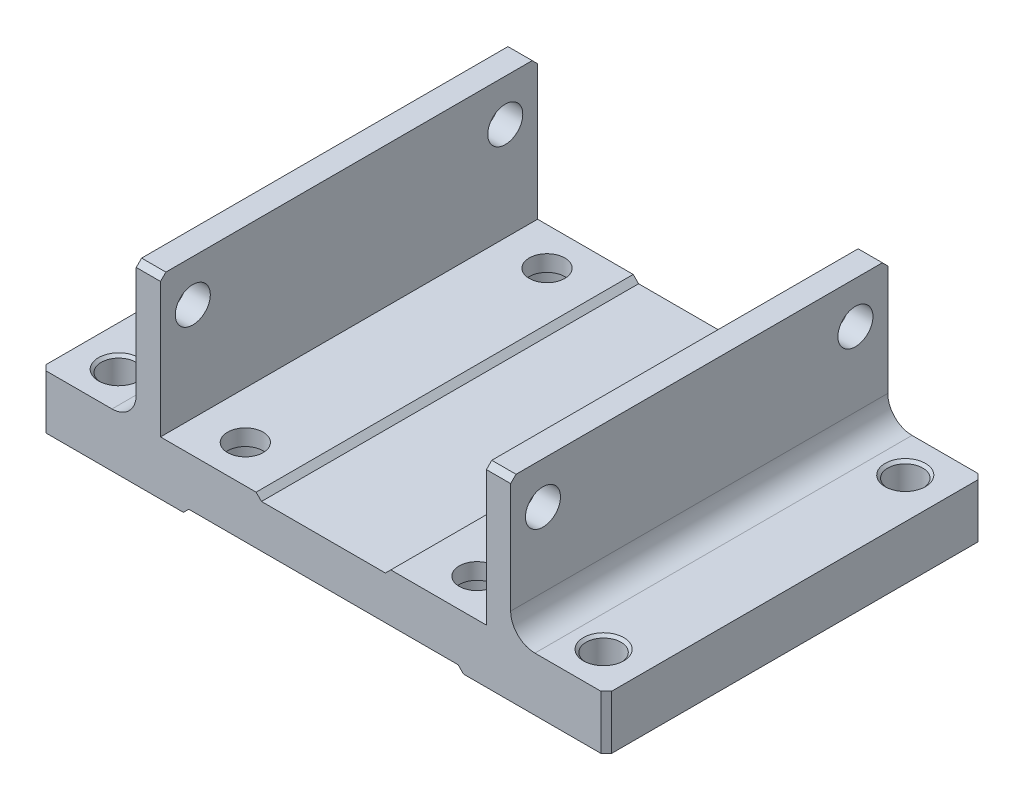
ISO-10303-21;
HEADER;
FILE_DESCRIPTION(('STEP AP214'),'2;1');
FILE_NAME('part.step','',(''),(''),'','','');
FILE_SCHEMA(('AUTOMOTIVE_DESIGN { 1 0 10303 214 1 1 1 1 }'));
ENDSEC;
DATA;
#1=APPLICATION_CONTEXT('core data for automotive mechanical design processes');
#2=APPLICATION_PROTOCOL_DEFINITION('international standard','automotive_design',2000,#1);
#3=PRODUCT_CONTEXT('',#1,'mechanical');
#4=PRODUCT('Part','Part','',(#3));
#5=PRODUCT_RELATED_PRODUCT_CATEGORY('part','',(#4));
#6=PRODUCT_DEFINITION_FORMATION('','',#4);
#7=PRODUCT_DEFINITION_CONTEXT('part definition',#1,'design');
#8=PRODUCT_DEFINITION('design','',#6,#7);
#9=PRODUCT_DEFINITION_SHAPE('','',#8);
#10=(LENGTH_UNIT() NAMED_UNIT(*) SI_UNIT(.MILLI.,.METRE.));
#11=(NAMED_UNIT(*) PLANE_ANGLE_UNIT() SI_UNIT($,.RADIAN.));
#12=(NAMED_UNIT(*) SI_UNIT($,.STERADIAN.) SOLID_ANGLE_UNIT());
#13=UNCERTAINTY_MEASURE_WITH_UNIT(LENGTH_MEASURE(1.E-05),#10,'distance_accuracy_value','');
#14=(GEOMETRIC_REPRESENTATION_CONTEXT(3) GLOBAL_UNCERTAINTY_ASSIGNED_CONTEXT((#13)) GLOBAL_UNIT_ASSIGNED_CONTEXT((#10,
#11,#12)) REPRESENTATION_CONTEXT('',''));
#15=CARTESIAN_POINT('',(0.,0.,0.));
#16=DIRECTION('',(0.,0.,1.));
#17=DIRECTION('',(1.,0.,0.));
#18=AXIS2_PLACEMENT_3D('',#15,#16,#17);
#19=CARTESIAN_POINT('',(45.,10.,-28.));
#20=DIRECTION('',(0.,1.,0.));
#21=DIRECTION('',(0.,0.,1.));
#22=AXIS2_PLACEMENT_3D('',#19,#20,#21);
#23=CYLINDRICAL_SURFACE('',#22,3.25);
#24=CARTESIAN_POINT('',(45.,0.499999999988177,-28.));
#25=DIRECTION('',(0.,-1.,0.));
#26=DIRECTION('',(0.,0.,-1.));
#27=AXIS2_PLACEMENT_3D('',#24,#25,#26);
#28=CIRCLE('',#27,3.25);
#29=CARTESIAN_POINT('',(45.,0.499999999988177,-31.25));
#30=VERTEX_POINT('',#29);
#31=EDGE_CURVE('E555',#30,#30,#28,.T.);
#32=ORIENTED_EDGE('',*,*,#31,.T.);
#33=EDGE_LOOP('',(#32));
#34=FACE_BOUND('',#33,.T.);
#35=CARTESIAN_POINT('',(45.,9.49999999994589,-28.));
#36=DIRECTION('',(0.,1.,0.));
#37=DIRECTION('',(0.,0.,1.));
#38=AXIS2_PLACEMENT_3D('',#35,#36,#37);
#39=CIRCLE('',#38,3.24999999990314);
#40=CARTESIAN_POINT('',(45.,9.49999999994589,-24.7500000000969));
#41=VERTEX_POINT('',#40);
#42=EDGE_CURVE('E549',#41,#41,#39,.T.);
#43=ORIENTED_EDGE('',*,*,#42,.T.);
#44=EDGE_LOOP('',(#43));
#45=FACE_BOUND('',#44,.T.);
#46=ADVANCED_FACE('F16',(#34,#45),#23,.F.);
#47=CARTESIAN_POINT('',(45.,10.,28.));
#48=DIRECTION('',(0.,1.,0.));
#49=DIRECTION('',(0.,0.,1.));
#50=AXIS2_PLACEMENT_3D('',#47,#48,#49);
#51=CYLINDRICAL_SURFACE('',#50,3.25);
#52=CARTESIAN_POINT('',(45.,0.499999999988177,28.));
#53=DIRECTION('',(0.,-1.,0.));
#54=DIRECTION('',(0.,0.,-1.));
#55=AXIS2_PLACEMENT_3D('',#52,#53,#54);
#56=CIRCLE('',#55,3.25000000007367);
#57=CARTESIAN_POINT('',(45.,0.499999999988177,24.7499999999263));
#58=VERTEX_POINT('',#57);
#59=EDGE_CURVE('E552',#58,#58,#56,.T.);
#60=ORIENTED_EDGE('',*,*,#59,.T.);
#61=EDGE_LOOP('',(#60));
#62=FACE_BOUND('',#61,.T.);
#63=CARTESIAN_POINT('',(45.,9.49999999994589,28.));
#64=DIRECTION('',(0.,1.,0.));
#65=DIRECTION('',(0.,0.,1.));
#66=AXIS2_PLACEMENT_3D('',#63,#64,#65);
#67=CIRCLE('',#66,3.25);
#68=CARTESIAN_POINT('',(45.,9.49999999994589,31.25));
#69=VERTEX_POINT('',#68);
#70=EDGE_CURVE('E546',#69,#69,#67,.T.);
#71=ORIENTED_EDGE('',*,*,#70,.T.);
#72=EDGE_LOOP('',(#71));
#73=FACE_BOUND('',#72,.T.);
#74=ADVANCED_FACE('F1427',(#62,#73),#51,.F.);
#75=CARTESIAN_POINT('',(-45.,10.,28.));
#76=DIRECTION('',(0.,1.,0.));
#77=DIRECTION('',(0.,0.,1.));
#78=AXIS2_PLACEMENT_3D('',#75,#76,#77);
#79=CYLINDRICAL_SURFACE('',#78,3.25);
#80=CARTESIAN_POINT('',(-45.,0.499999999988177,28.));
#81=DIRECTION('',(0.,-1.,0.));
#82=DIRECTION('',(0.,0.,-1.));
#83=AXIS2_PLACEMENT_3D('',#80,#81,#82);
#84=CIRCLE('',#83,3.25000000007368);
#85=CARTESIAN_POINT('',(-45.,0.499999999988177,24.7499999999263));
#86=VERTEX_POINT('',#85);
#87=EDGE_CURVE('E543',#86,#86,#84,.T.);
#88=ORIENTED_EDGE('',*,*,#87,.T.);
#89=EDGE_LOOP('',(#88));
#90=FACE_BOUND('',#89,.T.);
#91=CARTESIAN_POINT('',(-45.,9.50000000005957,28.));
#92=DIRECTION('',(0.,1.,0.));
#93=DIRECTION('',(0.,0.,1.));
#94=AXIS2_PLACEMENT_3D('',#91,#92,#93);
#95=CIRCLE('',#94,3.24999999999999);
#96=CARTESIAN_POINT('',(-45.,9.50000000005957,31.25));
#97=VERTEX_POINT('',#96);
#98=EDGE_CURVE('E496',#97,#97,#95,.T.);
#99=ORIENTED_EDGE('',*,*,#98,.T.);
#100=EDGE_LOOP('',(#99));
#101=FACE_BOUND('',#100,.T.);
#102=ADVANCED_FACE('F1418',(#90,#101),#79,.F.);
#103=CARTESIAN_POINT('',(-45.,10.,-28.));
#104=DIRECTION('',(0.,1.,0.));
#105=DIRECTION('',(0.,0.,1.));
#106=AXIS2_PLACEMENT_3D('',#103,#104,#105);
#107=CYLINDRICAL_SURFACE('',#106,3.25);
#108=CARTESIAN_POINT('',(-45.,0.499999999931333,-28.));
#109=DIRECTION('',(0.,-1.,0.));
#110=DIRECTION('',(0.,0.,-1.));
#111=AXIS2_PLACEMENT_3D('',#108,#109,#110);
#112=CIRCLE('',#111,3.25000000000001);
#113=CARTESIAN_POINT('',(-45.,0.499999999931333,-31.25));
#114=VERTEX_POINT('',#113);
#115=EDGE_CURVE('E540',#114,#114,#112,.T.);
#116=ORIENTED_EDGE('',*,*,#115,.T.);
#117=EDGE_LOOP('',(#116));
#118=FACE_BOUND('',#117,.T.);
#119=CARTESIAN_POINT('',(-45.,9.49999999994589,-28.));
#120=DIRECTION('',(0.,1.,0.));
#121=DIRECTION('',(0.,0.,1.));
#122=AXIS2_PLACEMENT_3D('',#119,#120,#121);
#123=CIRCLE('',#122,3.25000000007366);
#124=CARTESIAN_POINT('',(-45.,9.49999999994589,-24.7499999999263));
#125=VERTEX_POINT('',#124);
#126=EDGE_CURVE('E558',#125,#125,#123,.T.);
#127=ORIENTED_EDGE('',*,*,#126,.T.);
#128=EDGE_LOOP('',(#127));
#129=FACE_BOUND('',#128,.T.);
#130=ADVANCED_FACE('F1410',(#118,#129),#107,.F.);
#131=CARTESIAN_POINT('',(0.,36.,0.));
#132=DIRECTION('',(0.,1.,0.));
#133=DIRECTION('',(0.,0.,1.));
#134=AXIS2_PLACEMENT_3D('',#131,#132,#133);
#135=PLANE('',#134);
#136=DIRECTION('',(0.,0.,-1.));
#137=VECTOR('',#136,1.);
#138=CARTESIAN_POINT('',(30.25,36.,-35.));
#139=LINE('',#138,#137);
#140=CARTESIAN_POINT('',(30.25,36.,-34.));
#141=VERTEX_POINT('',#140);
#142=CARTESIAN_POINT('',(30.25,36.,34.));
#143=VERTEX_POINT('',#142);
#144=EDGE_CURVE('E421',#141,#143,#139,.F.);
#145=ORIENTED_EDGE('',*,*,#144,.T.);
#146=DIRECTION('',(1.,0.,0.));
#147=VECTOR('',#146,1.);
#148=CARTESIAN_POINT('',(0.,36.,34.));
#149=LINE('',#148,#147);
#150=CARTESIAN_POINT('',(34.75,36.,34.));
#151=VERTEX_POINT('',#150);
#152=EDGE_CURVE('E440',#151,#143,#149,.F.);
#153=ORIENTED_EDGE('',*,*,#152,.F.);
#154=DIRECTION('',(0.,0.,1.));
#155=VECTOR('',#154,1.);
#156=CARTESIAN_POINT('',(34.75,36.,-35.));
#157=LINE('',#156,#155);
#158=CARTESIAN_POINT('',(34.75,36.,-34.));
#159=VERTEX_POINT('',#158);
#160=EDGE_CURVE('E428',#151,#159,#157,.F.);
#161=ORIENTED_EDGE('',*,*,#160,.T.);
#162=DIRECTION('',(1.,0.,0.));
#163=VECTOR('',#162,1.);
#164=CARTESIAN_POINT('',(-52.5,36.,-34.));
#165=LINE('',#164,#163);
#166=EDGE_CURVE('E425',#141,#159,#165,.T.);
#167=ORIENTED_EDGE('',*,*,#166,.F.);
#168=EDGE_LOOP('',(#145,#153,#161,#167));
#169=FACE_BOUND('',#168,.T.);
#170=ADVANCED_FACE('F817',(#169),#135,.T.);
#171=CARTESIAN_POINT('',(-52.500025,28.25,29.));
#172=DIRECTION('',(1.,0.,0.));
#173=DIRECTION('',(0.,0.,-1.));
#174=AXIS2_PLACEMENT_3D('',#171,#172,#173);
#175=CYLINDRICAL_SURFACE('',#174,3.25);
#176=CARTESIAN_POINT('',(34.75,28.25,29.));
#177=DIRECTION('',(1.,0.,0.));
#178=DIRECTION('',(0.,0.,-1.));
#179=AXIS2_PLACEMENT_3D('',#176,#177,#178);
#180=CIRCLE('',#179,3.25);
#181=CARTESIAN_POINT('',(34.75,28.25,25.75));
#182=VERTEX_POINT('',#181);
#183=EDGE_CURVE('E426',#182,#182,#180,.T.);
#184=ORIENTED_EDGE('',*,*,#183,.T.);
#185=EDGE_LOOP('',(#184));
#186=FACE_BOUND('',#185,.T.);
#187=CARTESIAN_POINT('',(30.25,28.25,29.));
#188=DIRECTION('',(1.,0.,0.));
#189=DIRECTION('',(0.,0.,-1.));
#190=AXIS2_PLACEMENT_3D('',#187,#188,#189);
#191=CIRCLE('',#190,3.25);
#192=CARTESIAN_POINT('',(30.25,28.25,25.75));
#193=VERTEX_POINT('',#192);
#194=EDGE_CURVE('E418',#193,#193,#191,.F.);
#195=ORIENTED_EDGE('',*,*,#194,.T.);
#196=EDGE_LOOP('',(#195));
#197=FACE_BOUND('',#196,.T.);
#198=ADVANCED_FACE('F848',(#186,#197),#175,.F.);
#199=CARTESIAN_POINT('',(-52.500025,28.25,-29.));
#200=DIRECTION('',(1.,0.,0.));
#201=DIRECTION('',(0.,0.,-1.));
#202=AXIS2_PLACEMENT_3D('',#199,#200,#201);
#203=CYLINDRICAL_SURFACE('',#202,3.25000000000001);
#204=CARTESIAN_POINT('',(34.75,28.25,-29.));
#205=DIRECTION('',(1.,0.,0.));
#206=DIRECTION('',(0.,0.,-1.));
#207=AXIS2_PLACEMENT_3D('',#204,#205,#206);
#208=CIRCLE('',#207,3.25000000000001);
#209=CARTESIAN_POINT('',(34.75,28.25,-32.25));
#210=VERTEX_POINT('',#209);
#211=EDGE_CURVE('E422',#210,#210,#208,.T.);
#212=ORIENTED_EDGE('',*,*,#211,.T.);
#213=EDGE_LOOP('',(#212));
#214=FACE_BOUND('',#213,.T.);
#215=CARTESIAN_POINT('',(30.25,28.25,-29.));
#216=DIRECTION('',(1.,0.,0.));
#217=DIRECTION('',(0.,0.,-1.));
#218=AXIS2_PLACEMENT_3D('',#215,#216,#217);
#219=CIRCLE('',#218,3.25000000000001);
#220=CARTESIAN_POINT('',(30.25,28.25,-32.25));
#221=VERTEX_POINT('',#220);
#222=EDGE_CURVE('E415',#221,#221,#219,.F.);
#223=ORIENTED_EDGE('',*,*,#222,.T.);
#224=EDGE_LOOP('',(#223));
#225=FACE_BOUND('',#224,.T.);
#226=ADVANCED_FACE('F839',(#214,#225),#203,.F.);
#227=CARTESIAN_POINT('',(21.5,0.,-28.));
#228=DIRECTION('',(0.,-1.,0.));
#229=DIRECTION('',(0.,0.,-1.));
#230=AXIS2_PLACEMENT_3D('',#227,#228,#229);
#231=CYLINDRICAL_SURFACE('',#230,3.3);
#232=CARTESIAN_POINT('',(21.5,10.,-28.));
#233=DIRECTION('',(0.,-1.,0.));
#234=DIRECTION('',(0.,0.,-1.));
#235=AXIS2_PLACEMENT_3D('',#232,#233,#234);
#236=CIRCLE('',#235,3.3);
#237=CARTESIAN_POINT('',(21.5,10.,-31.3));
#238=VERTEX_POINT('',#237);
#239=EDGE_CURVE('E412',#238,#238,#236,.T.);
#240=ORIENTED_EDGE('',*,*,#239,.F.);
#241=EDGE_LOOP('',(#240));
#242=FACE_BOUND('',#241,.T.);
#243=CARTESIAN_POINT('',(21.5,7.,-28.));
#244=DIRECTION('',(0.,-1.,0.));
#245=DIRECTION('',(0.,0.,-1.));
#246=AXIS2_PLACEMENT_3D('',#243,#244,#245);
#247=CIRCLE('',#246,3.3);
#248=CARTESIAN_POINT('',(21.5,7.,-31.3));
#249=VERTEX_POINT('',#248);
#250=EDGE_CURVE('E429',#249,#249,#247,.T.);
#251=ORIENTED_EDGE('',*,*,#250,.T.);
#252=EDGE_LOOP('',(#251));
#253=FACE_BOUND('',#252,.T.);
#254=ADVANCED_FACE('F836',(#242,#253),#231,.F.);
#255=CARTESIAN_POINT('',(21.5,0.,28.));
#256=DIRECTION('',(0.,-1.,0.));
#257=DIRECTION('',(0.,0.,-1.));
#258=AXIS2_PLACEMENT_3D('',#255,#256,#257);
#259=CYLINDRICAL_SURFACE('',#258,3.3);
#260=CARTESIAN_POINT('',(21.5,10.,28.));
#261=DIRECTION('',(0.,-1.,0.));
#262=DIRECTION('',(0.,0.,-1.));
#263=AXIS2_PLACEMENT_3D('',#260,#261,#262);
#264=CIRCLE('',#263,3.3);
#265=CARTESIAN_POINT('',(21.5,10.,24.7));
#266=VERTEX_POINT('',#265);
#267=EDGE_CURVE('E408',#266,#266,#264,.T.);
#268=ORIENTED_EDGE('',*,*,#267,.F.);
#269=EDGE_LOOP('',(#268));
#270=FACE_BOUND('',#269,.T.);
#271=CARTESIAN_POINT('',(21.5,7.,28.));
#272=DIRECTION('',(0.,-1.,0.));
#273=DIRECTION('',(0.,0.,-1.));
#274=AXIS2_PLACEMENT_3D('',#271,#272,#273);
#275=CIRCLE('',#274,3.3);
#276=CARTESIAN_POINT('',(21.5,7.,24.7));
#277=VERTEX_POINT('',#276);
#278=EDGE_CURVE('E19',#277,#277,#275,.T.);
#279=ORIENTED_EDGE('',*,*,#278,.T.);
#280=EDGE_LOOP('',(#279));
#281=FACE_BOUND('',#280,.T.);
#282=ADVANCED_FACE('F838',(#270,#281),#259,.F.);
#283=CARTESIAN_POINT('',(12.5,10.,0.));
#284=DIRECTION('',(-0.707106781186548,0.707106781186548,0.));
#285=DIRECTION('',(-0.707106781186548,-0.707106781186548,0.));
#286=AXIS2_PLACEMENT_3D('',#283,#284,#285);
#287=PLANE('',#286);
#288=DIRECTION('',(-0.707106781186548,-0.707106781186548,0.));
#289=VECTOR('',#288,1.);
#290=CARTESIAN_POINT('',(12.5,10.,-35.));
#291=LINE('',#290,#289);
#292=CARTESIAN_POINT('',(12.4999999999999,10.,-35.));
#293=VERTEX_POINT('',#292);
#294=CARTESIAN_POINT('',(11.5,9.00000000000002,-35.));
#295=VERTEX_POINT('',#294);
#296=EDGE_CURVE('E241',#293,#295,#291,.T.);
#297=ORIENTED_EDGE('',*,*,#296,.T.);
#298=DIRECTION('',(0.,0.,1.));
#299=VECTOR('',#298,1.);
#300=CARTESIAN_POINT('',(11.5,9.00000000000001,-35.00005));
#301=LINE('',#300,#299);
#302=CARTESIAN_POINT('',(11.5,9.00000000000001,35.));
#303=VERTEX_POINT('',#302);
#304=EDGE_CURVE('E244',#295,#303,#301,.T.);
#305=ORIENTED_EDGE('',*,*,#304,.T.);
#306=DIRECTION('',(-0.707106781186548,-0.707106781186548,0.));
#307=VECTOR('',#306,1.);
#308=CARTESIAN_POINT('',(12.5,10.,35.));
#309=LINE('',#308,#307);
#310=CARTESIAN_POINT('',(12.4999999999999,10.,35.));
#311=VERTEX_POINT('',#310);
#312=EDGE_CURVE('E229',#303,#311,#309,.F.);
#313=ORIENTED_EDGE('',*,*,#312,.T.);
#314=DIRECTION('',(0.,0.,1.));
#315=VECTOR('',#314,1.);
#316=CARTESIAN_POINT('',(12.4999999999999,10.,0.));
#317=LINE('',#316,#315);
#318=EDGE_CURVE('E564',#293,#311,#317,.T.);
#319=ORIENTED_EDGE('',*,*,#318,.F.);
#320=EDGE_LOOP('',(#297,#305,#313,#319));
#321=FACE_BOUND('',#320,.T.);
#322=ADVANCED_FACE('F245',(#321),#287,.T.);
#323=CARTESIAN_POINT('',(-11.5,9.,-35.00005));
#324=DIRECTION('',(0.707106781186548,0.707106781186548,0.));
#325=DIRECTION('',(-0.707106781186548,0.707106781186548,0.));
#326=AXIS2_PLACEMENT_3D('',#323,#324,#325);
#327=PLANE('',#326);
#328=DIRECTION('',(-0.707106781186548,0.707106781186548,0.));
#329=VECTOR('',#328,1.);
#330=CARTESIAN_POINT('',(-11.5,9.,-35.));
#331=LINE('',#330,#329);
#332=CARTESIAN_POINT('',(-11.5,9.,-35.));
#333=VERTEX_POINT('',#332);
#334=CARTESIAN_POINT('',(-12.5,10.,-35.));
#335=VERTEX_POINT('',#334);
#336=EDGE_CURVE('E494',#333,#335,#331,.T.);
#337=ORIENTED_EDGE('',*,*,#336,.T.);
#338=DIRECTION('',(0.,0.,1.));
#339=VECTOR('',#338,1.);
#340=CARTESIAN_POINT('',(-12.5,10.,0.));
#341=LINE('',#340,#339);
#342=CARTESIAN_POINT('',(-12.5,10.,35.));
#343=VERTEX_POINT('',#342);
#344=EDGE_CURVE('E405',#343,#335,#341,.F.);
#345=ORIENTED_EDGE('',*,*,#344,.F.);
#346=DIRECTION('',(-0.707106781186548,0.707106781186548,0.));
#347=VECTOR('',#346,1.);
#348=CARTESIAN_POINT('',(-11.5,9.,35.));
#349=LINE('',#348,#347);
#350=CARTESIAN_POINT('',(-11.5,9.,35.));
#351=VERTEX_POINT('',#350);
#352=EDGE_CURVE('E497',#343,#351,#349,.F.);
#353=ORIENTED_EDGE('',*,*,#352,.T.);
#354=DIRECTION('',(0.,0.,1.));
#355=VECTOR('',#354,1.);
#356=CARTESIAN_POINT('',(-11.5,9.00000000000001,-35.00005));
#357=LINE('',#356,#355);
#358=EDGE_CURVE('E250',#351,#333,#357,.F.);
#359=ORIENTED_EDGE('',*,*,#358,.T.);
#360=EDGE_LOOP('',(#337,#345,#353,#359));
#361=FACE_BOUND('',#360,.T.);
#362=ADVANCED_FACE('F1040',(#361),#327,.T.);
#363=CARTESIAN_POINT('',(0.,36.,0.));
#364=DIRECTION('',(0.,1.,0.));
#365=DIRECTION('',(0.,0.,1.));
#366=AXIS2_PLACEMENT_3D('',#363,#364,#365);
#367=PLANE('',#366);
#368=DIRECTION('',(0.,0.,1.));
#369=VECTOR('',#368,1.);
#370=CARTESIAN_POINT('',(-30.25,36.,-35.));
#371=LINE('',#370,#369);
#372=CARTESIAN_POINT('',(-30.25,36.,34.));
#373=VERTEX_POINT('',#372);
#374=CARTESIAN_POINT('',(-30.25,36.,-34.));
#375=VERTEX_POINT('',#374);
#376=EDGE_CURVE('E401',#373,#375,#371,.F.);
#377=ORIENTED_EDGE('',*,*,#376,.T.);
#378=DIRECTION('',(1.,0.,0.));
#379=VECTOR('',#378,1.);
#380=CARTESIAN_POINT('',(0.,36.,-34.));
#381=LINE('',#380,#379);
#382=CARTESIAN_POINT('',(-34.75,36.,-34.));
#383=VERTEX_POINT('',#382);
#384=EDGE_CURVE('E473',#383,#375,#381,.T.);
#385=ORIENTED_EDGE('',*,*,#384,.F.);
#386=DIRECTION('',(0.,0.,-1.));
#387=VECTOR('',#386,1.);
#388=CARTESIAN_POINT('',(-34.75,36.,-35.));
#389=LINE('',#388,#387);
#390=CARTESIAN_POINT('',(-34.75,36.,34.));
#391=VERTEX_POINT('',#390);
#392=EDGE_CURVE('E467',#383,#391,#389,.F.);
#393=ORIENTED_EDGE('',*,*,#392,.T.);
#394=DIRECTION('',(1.,0.,0.));
#395=VECTOR('',#394,1.);
#396=CARTESIAN_POINT('',(-52.5,36.,34.));
#397=LINE('',#396,#395);
#398=EDGE_CURVE('E446',#373,#391,#397,.F.);
#399=ORIENTED_EDGE('',*,*,#398,.F.);
#400=EDGE_LOOP('',(#377,#385,#393,#399));
#401=FACE_BOUND('',#400,.T.);
#402=ADVANCED_FACE('F1036',(#401),#367,.T.);
#403=CARTESIAN_POINT('',(-52.500025,28.25,29.));
#404=DIRECTION('',(1.,0.,0.));
#405=DIRECTION('',(0.,0.,-1.));
#406=AXIS2_PLACEMENT_3D('',#403,#404,#405);
#407=CYLINDRICAL_SURFACE('',#406,3.25);
#408=CARTESIAN_POINT('',(-30.25,28.25,29.));
#409=DIRECTION('',(1.,0.,0.));
#410=DIRECTION('',(0.,0.,-1.));
#411=AXIS2_PLACEMENT_3D('',#408,#409,#410);
#412=CIRCLE('',#411,3.25);
#413=CARTESIAN_POINT('',(-30.25,28.25,25.75));
#414=VERTEX_POINT('',#413);
#415=EDGE_CURVE('E398',#414,#414,#412,.T.);
#416=ORIENTED_EDGE('',*,*,#415,.T.);
#417=EDGE_LOOP('',(#416));
#418=FACE_BOUND('',#417,.T.);
#419=CARTESIAN_POINT('',(-34.75,28.25,29.));
#420=DIRECTION('',(1.,0.,0.));
#421=DIRECTION('',(0.,0.,-1.));
#422=AXIS2_PLACEMENT_3D('',#419,#420,#421);
#423=CIRCLE('',#422,3.25);
#424=CARTESIAN_POINT('',(-34.75,28.25,25.75));
#425=VERTEX_POINT('',#424);
#426=EDGE_CURVE('E390',#425,#425,#423,.F.);
#427=ORIENTED_EDGE('',*,*,#426,.T.);
#428=EDGE_LOOP('',(#427));
#429=FACE_BOUND('',#428,.T.);
#430=ADVANCED_FACE('F1032',(#418,#429),#407,.F.);
#431=CARTESIAN_POINT('',(-52.500025,28.25,-29.));
#432=DIRECTION('',(1.,0.,0.));
#433=DIRECTION('',(0.,0.,-1.));
#434=AXIS2_PLACEMENT_3D('',#431,#432,#433);
#435=CYLINDRICAL_SURFACE('',#434,3.25000000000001);
#436=CARTESIAN_POINT('',(-30.25,28.25,-29.));
#437=DIRECTION('',(1.,0.,0.));
#438=DIRECTION('',(0.,0.,-1.));
#439=AXIS2_PLACEMENT_3D('',#436,#437,#438);
#440=CIRCLE('',#439,3.25000000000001);
#441=CARTESIAN_POINT('',(-30.25,28.25,-32.25));
#442=VERTEX_POINT('',#441);
#443=EDGE_CURVE('E394',#442,#442,#440,.T.);
#444=ORIENTED_EDGE('',*,*,#443,.T.);
#445=EDGE_LOOP('',(#444));
#446=FACE_BOUND('',#445,.T.);
#447=CARTESIAN_POINT('',(-34.75,28.25,-29.));
#448=DIRECTION('',(1.,0.,0.));
#449=DIRECTION('',(0.,0.,-1.));
#450=AXIS2_PLACEMENT_3D('',#447,#448,#449);
#451=CIRCLE('',#450,3.25000000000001);
#452=CARTESIAN_POINT('',(-34.75,28.25,-32.25));
#453=VERTEX_POINT('',#452);
#454=EDGE_CURVE('E386',#453,#453,#451,.F.);
#455=ORIENTED_EDGE('',*,*,#454,.T.);
#456=EDGE_LOOP('',(#455));
#457=FACE_BOUND('',#456,.T.);
#458=ADVANCED_FACE('F1028',(#446,#457),#435,.F.);
#459=CARTESIAN_POINT('',(-45.,9.99999999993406,28.));
#460=DIRECTION('',(0.,1.,0.));
#461=DIRECTION('',(0.,0.,1.));
#462=AXIS2_PLACEMENT_3D('',#459,#460,#461);
#463=CONICAL_SURFACE('',#462,3.74999999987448,0.785398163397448);
#464=ORIENTED_EDGE('',*,*,#98,.F.);
#465=EDGE_LOOP('',(#464));
#466=FACE_BOUND('',#465,.T.);
#467=CARTESIAN_POINT('',(-45.,9.99999999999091,28.));
#468=DIRECTION('',(0.,1.,0.));
#469=DIRECTION('',(0.,0.,1.));
#470=AXIS2_PLACEMENT_3D('',#467,#468,#469);
#471=CIRCLE('',#470,3.74999999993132);
#472=CARTESIAN_POINT('',(-45.,9.99999999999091,31.7499999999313));
#473=VERTEX_POINT('',#472);
#474=EDGE_CURVE('E383',#473,#473,#471,.F.);
#475=ORIENTED_EDGE('',*,*,#474,.F.);
#476=EDGE_LOOP('',(#475));
#477=FACE_BOUND('',#476,.T.);
#478=ADVANCED_FACE('F1024',(#466,#477),#463,.F.);
#479=CARTESIAN_POINT('',(-45.,9.99999999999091,-28.));
#480=DIRECTION('',(0.,1.,0.));
#481=DIRECTION('',(0.,0.,1.));
#482=AXIS2_PLACEMENT_3D('',#479,#480,#481);
#483=CONICAL_SURFACE('',#482,3.75000000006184,0.785398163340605);
#484=ORIENTED_EDGE('',*,*,#126,.F.);
#485=EDGE_LOOP('',(#484));
#486=FACE_BOUND('',#485,.T.);
#487=CARTESIAN_POINT('',(-45.,9.99999999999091,-28.));
#488=DIRECTION('',(0.,1.,0.));
#489=DIRECTION('',(0.,0.,1.));
#490=AXIS2_PLACEMENT_3D('',#487,#488,#489);
#491=CIRCLE('',#490,3.75000000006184);
#492=CARTESIAN_POINT('',(-45.,9.99999999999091,-24.2499999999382));
#493=VERTEX_POINT('',#492);
#494=EDGE_CURVE('E379',#493,#493,#491,.F.);
#495=ORIENTED_EDGE('',*,*,#494,.F.);
#496=EDGE_LOOP('',(#495));
#497=FACE_BOUND('',#496,.T.);
#498=ADVANCED_FACE('F1020',(#486,#497),#483,.F.);
#499=CARTESIAN_POINT('',(45.,5.6843418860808E-11,-28.));
#500=DIRECTION('',(0.,-1.,0.));
#501=DIRECTION('',(0.,0.,-1.));
#502=AXIS2_PLACEMENT_3D('',#499,#500,#501);
#503=CONICAL_SURFACE('',#502,3.74999999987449,0.785398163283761);
#504=ORIENTED_EDGE('',*,*,#31,.F.);
#505=EDGE_LOOP('',(#504));
#506=FACE_BOUND('',#505,.T.);
#507=CARTESIAN_POINT('',(45.,0.,-28.));
#508=DIRECTION('',(0.,-1.,0.));
#509=DIRECTION('',(0.,0.,-1.));
#510=AXIS2_PLACEMENT_3D('',#507,#508,#509);
#511=CIRCLE('',#510,3.74999999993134);
#512=CARTESIAN_POINT('',(45.,0.,-31.7499999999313));
#513=VERTEX_POINT('',#512);
#514=EDGE_CURVE('E375',#513,#513,#511,.T.);
#515=ORIENTED_EDGE('',*,*,#514,.T.);
#516=EDGE_LOOP('',(#515));
#517=FACE_BOUND('',#516,.T.);
#518=ADVANCED_FACE('F1016',(#506,#517),#503,.F.);
#519=CARTESIAN_POINT('',(45.,5.6843418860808E-11,28.));
#520=DIRECTION('',(0.,-1.,0.));
#521=DIRECTION('',(0.,0.,-1.));
#522=AXIS2_PLACEMENT_3D('',#519,#520,#521);
#523=CONICAL_SURFACE('',#522,3.75000000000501,0.785398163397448);
#524=ORIENTED_EDGE('',*,*,#59,.F.);
#525=EDGE_LOOP('',(#524));
#526=FACE_BOUND('',#525,.T.);
#527=CARTESIAN_POINT('',(45.,5.6843418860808E-11,28.));
#528=DIRECTION('',(0.,-1.,0.));
#529=DIRECTION('',(0.,0.,-1.));
#530=AXIS2_PLACEMENT_3D('',#527,#528,#529);
#531=CIRCLE('',#530,3.75000000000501);
#532=CARTESIAN_POINT('',(45.,5.6843418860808E-11,24.249999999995));
#533=VERTEX_POINT('',#532);
#534=EDGE_CURVE('E371',#533,#533,#531,.T.);
#535=ORIENTED_EDGE('',*,*,#534,.T.);
#536=EDGE_LOOP('',(#535));
#537=FACE_BOUND('',#536,.T.);
#538=ADVANCED_FACE('F1013',(#526,#537),#523,.F.);
#539=CARTESIAN_POINT('',(52.5,10.,-35.));
#540=DIRECTION('',(-1.,0.,0.));
#541=DIRECTION('',(0.,0.,1.));
#542=AXIS2_PLACEMENT_3D('',#539,#540,#541);
#543=PLANE('',#542);
#544=DIRECTION('',(0.,1.,0.));
#545=VECTOR('',#544,1.);
#546=CARTESIAN_POINT('',(52.5,10.,34.));
#547=LINE('',#546,#545);
#548=CARTESIAN_POINT('',(52.5,10.,34.));
#549=VERTEX_POINT('',#548);
#550=CARTESIAN_POINT('',(52.5,0.,34.));
#551=VERTEX_POINT('',#550);
#552=EDGE_CURVE('E437',#549,#551,#547,.F.);
#553=ORIENTED_EDGE('',*,*,#552,.T.);
#554=DIRECTION('',(0.,0.,1.));
#555=VECTOR('',#554,1.);
#556=CARTESIAN_POINT('',(52.5,0.,0.));
#557=LINE('',#556,#555);
#558=CARTESIAN_POINT('',(52.5,0.,-33.9999999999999));
#559=VERTEX_POINT('',#558);
#560=EDGE_CURVE('E454',#551,#559,#557,.F.);
#561=ORIENTED_EDGE('',*,*,#560,.T.);
#562=DIRECTION('',(0.,1.,0.));
#563=VECTOR('',#562,1.);
#564=CARTESIAN_POINT('',(52.5,10.,-33.9999999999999));
#565=LINE('',#564,#563);
#566=CARTESIAN_POINT('',(52.5,10.,-33.9999999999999));
#567=VERTEX_POINT('',#566);
#568=EDGE_CURVE('E456',#559,#567,#565,.T.);
#569=ORIENTED_EDGE('',*,*,#568,.T.);
#570=DIRECTION('',(0.,0.,1.));
#571=VECTOR('',#570,1.);
#572=CARTESIAN_POINT('',(52.5,10.,0.));
#573=LINE('',#572,#571);
#574=EDGE_CURVE('E610',#549,#567,#573,.F.);
#575=ORIENTED_EDGE('',*,*,#574,.F.);
#576=EDGE_LOOP('',(#553,#561,#569,#575));
#577=FACE_BOUND('',#576,.T.);
#578=ADVANCED_FACE('F1009',(#577),#543,.F.);
#579=CARTESIAN_POINT('',(45.,10.0000000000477,-28.));
#580=DIRECTION('',(0.,1.,0.));
#581=DIRECTION('',(0.,0.,1.));
#582=AXIS2_PLACEMENT_3D('',#579,#580,#581);
#583=CONICAL_SURFACE('',#582,3.750000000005,0.785398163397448);
#584=ORIENTED_EDGE('',*,*,#42,.F.);
#585=EDGE_LOOP('',(#584));
#586=FACE_BOUND('',#585,.T.);
#587=CARTESIAN_POINT('',(45.,10.0000000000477,-28.));
#588=DIRECTION('',(0.,1.,0.));
#589=DIRECTION('',(0.,0.,1.));
#590=AXIS2_PLACEMENT_3D('',#587,#588,#589);
#591=CIRCLE('',#590,3.750000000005);
#592=CARTESIAN_POINT('',(45.,10.0000000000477,-24.249999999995));
#593=VERTEX_POINT('',#592);
#594=EDGE_CURVE('E367',#593,#593,#591,.F.);
#595=ORIENTED_EDGE('',*,*,#594,.F.);
#596=EDGE_LOOP('',(#595));
#597=FACE_BOUND('',#596,.T.);
#598=ADVANCED_FACE('F1005',(#586,#597),#583,.F.);
#599=CARTESIAN_POINT('',(45.,9.99999999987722,28.));
#600=DIRECTION('',(0.,1.,0.));
#601=DIRECTION('',(0.,0.,1.));
#602=AXIS2_PLACEMENT_3D('',#599,#600,#601);
#603=CONICAL_SURFACE('',#602,3.74999999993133,0.785398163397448);
#604=ORIENTED_EDGE('',*,*,#70,.F.);
#605=EDGE_LOOP('',(#604));
#606=FACE_BOUND('',#605,.T.);
#607=CARTESIAN_POINT('',(45.,9.99999999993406,28.));
#608=DIRECTION('',(0.,1.,0.));
#609=DIRECTION('',(0.,0.,1.));
#610=AXIS2_PLACEMENT_3D('',#607,#608,#609);
#611=CIRCLE('',#610,3.74999999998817);
#612=CARTESIAN_POINT('',(45.,9.99999999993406,31.7499999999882));
#613=VERTEX_POINT('',#612);
#614=EDGE_CURVE('E364',#613,#613,#611,.F.);
#615=ORIENTED_EDGE('',*,*,#614,.F.);
#616=EDGE_LOOP('',(#615));
#617=FACE_BOUND('',#616,.T.);
#618=ADVANCED_FACE('F1001',(#606,#617),#603,.F.);
#619=CARTESIAN_POINT('',(-21.5,0.,-28.));
#620=DIRECTION('',(0.,-1.,0.));
#621=DIRECTION('',(0.,0.,-1.));
#622=AXIS2_PLACEMENT_3D('',#619,#620,#621);
#623=CYLINDRICAL_SURFACE('',#622,3.29999999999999);
#624=CARTESIAN_POINT('',(-21.5,10.,-28.));
#625=DIRECTION('',(0.,-1.,0.));
#626=DIRECTION('',(0.,0.,-1.));
#627=AXIS2_PLACEMENT_3D('',#624,#625,#626);
#628=CIRCLE('',#627,3.29999999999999);
#629=CARTESIAN_POINT('',(-21.5,10.,-31.3));
#630=VERTEX_POINT('',#629);
#631=EDGE_CURVE('E402',#630,#630,#628,.T.);
#632=ORIENTED_EDGE('',*,*,#631,.F.);
#633=EDGE_LOOP('',(#632));
#634=FACE_BOUND('',#633,.T.);
#635=CARTESIAN_POINT('',(-21.5,7.,-28.));
#636=DIRECTION('',(0.,-1.,0.));
#637=DIRECTION('',(0.,0.,-1.));
#638=AXIS2_PLACEMENT_3D('',#635,#636,#637);
#639=CIRCLE('',#638,3.29999999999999);
#640=CARTESIAN_POINT('',(-21.5,7.,-31.3));
#641=VERTEX_POINT('',#640);
#642=EDGE_CURVE('E361',#641,#641,#639,.T.);
#643=ORIENTED_EDGE('',*,*,#642,.T.);
#644=EDGE_LOOP('',(#643));
#645=FACE_BOUND('',#644,.T.);
#646=ADVANCED_FACE('F997',(#634,#645),#623,.F.);
#647=CARTESIAN_POINT('',(-21.5,0.,28.));
#648=DIRECTION('',(0.,-1.,0.));
#649=DIRECTION('',(0.,0.,-1.));
#650=AXIS2_PLACEMENT_3D('',#647,#648,#649);
#651=CYLINDRICAL_SURFACE('',#650,3.3);
#652=CARTESIAN_POINT('',(-21.5,10.,28.));
#653=DIRECTION('',(0.,-1.,0.));
#654=DIRECTION('',(0.,0.,-1.));
#655=AXIS2_PLACEMENT_3D('',#652,#653,#654);
#656=CIRCLE('',#655,3.3);
#657=CARTESIAN_POINT('',(-21.5,10.,24.7));
#658=VERTEX_POINT('',#657);
#659=EDGE_CURVE('E249',#658,#658,#656,.T.);
#660=ORIENTED_EDGE('',*,*,#659,.F.);
#661=EDGE_LOOP('',(#660));
#662=FACE_BOUND('',#661,.T.);
#663=CARTESIAN_POINT('',(-21.5,7.,28.));
#664=DIRECTION('',(0.,-1.,0.));
#665=DIRECTION('',(0.,0.,-1.));
#666=AXIS2_PLACEMENT_3D('',#663,#664,#665);
#667=CIRCLE('',#666,3.3);
#668=CARTESIAN_POINT('',(-21.5,7.,24.7));
#669=VERTEX_POINT('',#668);
#670=EDGE_CURVE('E357',#669,#669,#667,.T.);
#671=ORIENTED_EDGE('',*,*,#670,.T.);
#672=EDGE_LOOP('',(#671));
#673=FACE_BOUND('',#672,.T.);
#674=ADVANCED_FACE('F993',(#662,#673),#651,.F.);
#675=CARTESIAN_POINT('',(-52.5,10.,-35.));
#676=DIRECTION('',(1.,0.,0.));
#677=DIRECTION('',(0.,0.,-1.));
#678=AXIS2_PLACEMENT_3D('',#675,#676,#677);
#679=PLANE('',#678);
#680=DIRECTION('',(0.,1.,0.));
#681=VECTOR('',#680,1.);
#682=CARTESIAN_POINT('',(-52.5,10.,-34.));
#683=LINE('',#682,#681);
#684=CARTESIAN_POINT('',(-52.5,10.,-34.));
#685=VERTEX_POINT('',#684);
#686=CARTESIAN_POINT('',(-52.5,0.,-34.));
#687=VERTEX_POINT('',#686);
#688=EDGE_CURVE('E378',#685,#687,#683,.F.);
#689=ORIENTED_EDGE('',*,*,#688,.T.);
#690=DIRECTION('',(0.,0.,1.));
#691=VECTOR('',#690,1.);
#692=CARTESIAN_POINT('',(-52.5,0.,0.));
#693=LINE('',#692,#691);
#694=CARTESIAN_POINT('',(-52.5,0.,34.));
#695=VERTEX_POINT('',#694);
#696=EDGE_CURVE('E356',#687,#695,#693,.T.);
#697=ORIENTED_EDGE('',*,*,#696,.T.);
#698=DIRECTION('',(0.,1.,0.));
#699=VECTOR('',#698,1.);
#700=CARTESIAN_POINT('',(-52.5,10.,34.));
#701=LINE('',#700,#699);
#702=CARTESIAN_POINT('',(-52.5,10.,34.));
#703=VERTEX_POINT('',#702);
#704=EDGE_CURVE('E464',#695,#703,#701,.T.);
#705=ORIENTED_EDGE('',*,*,#704,.T.);
#706=DIRECTION('',(0.,0.,1.));
#707=VECTOR('',#706,1.);
#708=CARTESIAN_POINT('',(-52.5,10.,0.));
#709=LINE('',#708,#707);
#710=EDGE_CURVE('E459',#685,#703,#709,.T.);
#711=ORIENTED_EDGE('',*,*,#710,.F.);
#712=EDGE_LOOP('',(#689,#697,#705,#711));
#713=FACE_BOUND('',#712,.T.);
#714=ADVANCED_FACE('F989',(#713),#679,.F.);
#715=CARTESIAN_POINT('',(-45.,-5.6843418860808E-11,28.));
#716=DIRECTION('',(0.,-1.,0.));
#717=DIRECTION('',(0.,0.,-1.));
#718=AXIS2_PLACEMENT_3D('',#715,#716,#717);
#719=CONICAL_SURFACE('',#718,3.75000000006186,0.785398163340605);
#720=ORIENTED_EDGE('',*,*,#87,.F.);
#721=EDGE_LOOP('',(#720));
#722=FACE_BOUND('',#721,.T.);
#723=CARTESIAN_POINT('',(-45.,-5.6843418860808E-11,28.));
#724=DIRECTION('',(0.,-1.,0.));
#725=DIRECTION('',(0.,0.,-1.));
#726=AXIS2_PLACEMENT_3D('',#723,#724,#725);
#727=CIRCLE('',#726,3.75000000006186);
#728=CARTESIAN_POINT('',(-45.,-5.6843418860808E-11,24.2499999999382));
#729=VERTEX_POINT('',#728);
#730=EDGE_CURVE('E353',#729,#729,#727,.T.);
#731=ORIENTED_EDGE('',*,*,#730,.T.);
#732=EDGE_LOOP('',(#731));
#733=FACE_BOUND('',#732,.T.);
#734=ADVANCED_FACE('F985',(#722,#733),#719,.F.);
#735=CARTESIAN_POINT('',(-45.,0.,-28.));
#736=DIRECTION('',(0.,-1.,0.));
#737=DIRECTION('',(0.,0.,-1.));
#738=AXIS2_PLACEMENT_3D('',#735,#736,#737);
#739=CONICAL_SURFACE('',#738,3.74999999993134,0.785398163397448);
#740=ORIENTED_EDGE('',*,*,#115,.F.);
#741=EDGE_LOOP('',(#740));
#742=FACE_BOUND('',#741,.T.);
#743=CARTESIAN_POINT('',(-45.,0.,-28.));
#744=DIRECTION('',(0.,-1.,0.));
#745=DIRECTION('',(0.,0.,-1.));
#746=AXIS2_PLACEMENT_3D('',#743,#744,#745);
#747=CIRCLE('',#746,3.74999999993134);
#748=CARTESIAN_POINT('',(-45.,0.,-31.7499999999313));
#749=VERTEX_POINT('',#748);
#750=EDGE_CURVE('E349',#749,#749,#747,.T.);
#751=ORIENTED_EDGE('',*,*,#750,.T.);
#752=EDGE_LOOP('',(#751));
#753=FACE_BOUND('',#752,.T.);
#754=ADVANCED_FACE('F981',(#742,#753),#739,.F.);
#755=CARTESIAN_POINT('',(-52.5,10.,34.));
#756=DIRECTION('',(0.707106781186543,0.,-0.707106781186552));
#757=DIRECTION('',(-0.707106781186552,0.,-0.707106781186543));
#758=AXIS2_PLACEMENT_3D('',#755,#756,#757);
#759=PLANE('',#758);
#760=DIRECTION('',(0.,1.,0.));
#761=VECTOR('',#760,1.);
#762=CARTESIAN_POINT('',(-51.5,10.,35.));
#763=LINE('',#762,#761);
#764=CARTESIAN_POINT('',(-51.5,0.,35.));
#765=VERTEX_POINT('',#764);
#766=CARTESIAN_POINT('',(-51.5,10.,35.));
#767=VERTEX_POINT('',#766);
#768=EDGE_CURVE('E648',#765,#767,#763,.T.);
#769=ORIENTED_EDGE('',*,*,#768,.T.);
#770=DIRECTION('',(0.707106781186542,0.,0.707106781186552));
#771=VECTOR('',#770,1.);
#772=CARTESIAN_POINT('',(-52.5,10.,34.));
#773=LINE('',#772,#771);
#774=EDGE_CURVE('E128',#703,#767,#773,.T.);
#775=ORIENTED_EDGE('',*,*,#774,.F.);
#776=ORIENTED_EDGE('',*,*,#704,.F.);
#777=DIRECTION('',(0.707106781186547,0.,0.707106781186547));
#778=VECTOR('',#777,1.);
#779=CARTESIAN_POINT('',(-52.5,0.,34.));
#780=LINE('',#779,#778);
#781=EDGE_CURVE('E360',#695,#765,#780,.T.);
#782=ORIENTED_EDGE('',*,*,#781,.T.);
#783=EDGE_LOOP('',(#769,#775,#776,#782));
#784=FACE_BOUND('',#783,.T.);
#785=ADVANCED_FACE('F978',(#784),#759,.F.);
#786=CARTESIAN_POINT('',(-52.5,35.,35.));
#787=DIRECTION('',(0.,0.707106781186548,0.707106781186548));
#788=DIRECTION('',(0.,-0.707106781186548,0.707106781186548));
#789=AXIS2_PLACEMENT_3D('',#786,#787,#788);
#790=PLANE('',#789);
#791=DIRECTION('',(0.,-0.707106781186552,0.707106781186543));
#792=VECTOR('',#791,1.);
#793=CARTESIAN_POINT('',(-34.75,36.,34.));
#794=LINE('',#793,#792);
#795=CARTESIAN_POINT('',(-34.75,35.,35.));
#796=VERTEX_POINT('',#795);
#797=EDGE_CURVE('E393',#391,#796,#794,.T.);
#798=ORIENTED_EDGE('',*,*,#797,.T.);
#799=DIRECTION('',(-1.,0.,0.));
#800=VECTOR('',#799,1.);
#801=CARTESIAN_POINT('',(-52.5,35.,35.));
#802=LINE('',#801,#800);
#803=CARTESIAN_POINT('',(-30.25,35.,35.));
#804=VERTEX_POINT('',#803);
#805=EDGE_CURVE('E489',#796,#804,#802,.F.);
#806=ORIENTED_EDGE('',*,*,#805,.T.);
#807=DIRECTION('',(0.,0.707106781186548,-0.707106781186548));
#808=VECTOR('',#807,1.);
#809=CARTESIAN_POINT('',(-30.25,35.,35.));
#810=LINE('',#809,#808);
#811=EDGE_CURVE('E479',#804,#373,#810,.T.);
#812=ORIENTED_EDGE('',*,*,#811,.T.);
#813=ORIENTED_EDGE('',*,*,#398,.T.);
#814=EDGE_LOOP('',(#798,#806,#812,#813));
#815=FACE_BOUND('',#814,.T.);
#816=ADVANCED_FACE('F742',(#815),#790,.T.);
#817=CARTESIAN_POINT('',(0.,36.,34.));
#818=DIRECTION('',(0.,0.707106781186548,0.707106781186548));
#819=DIRECTION('',(0.,-0.707106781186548,0.707106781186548));
#820=AXIS2_PLACEMENT_3D('',#817,#818,#819);
#821=PLANE('',#820);
#822=DIRECTION('',(0.,0.707106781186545,-0.70710678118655));
#823=VECTOR('',#822,1.);
#824=CARTESIAN_POINT('',(34.75,35.,35.));
#825=LINE('',#824,#823);
#826=CARTESIAN_POINT('',(34.75,35.,35.));
#827=VERTEX_POINT('',#826);
#828=EDGE_CURVE('E434',#827,#151,#825,.T.);
#829=ORIENTED_EDGE('',*,*,#828,.T.);
#830=ORIENTED_EDGE('',*,*,#152,.T.);
#831=DIRECTION('',(0.,-0.70710678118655,0.707106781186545));
#832=VECTOR('',#831,1.);
#833=CARTESIAN_POINT('',(30.25,36.,34.));
#834=LINE('',#833,#832);
#835=CARTESIAN_POINT('',(30.25,35.,35.));
#836=VERTEX_POINT('',#835);
#837=EDGE_CURVE('E537',#143,#836,#834,.T.);
#838=ORIENTED_EDGE('',*,*,#837,.T.);
#839=DIRECTION('',(-1.,0.,0.));
#840=VECTOR('',#839,1.);
#841=CARTESIAN_POINT('',(-52.5,35.,35.));
#842=LINE('',#841,#840);
#843=EDGE_CURVE('E618',#836,#827,#842,.F.);
#844=ORIENTED_EDGE('',*,*,#843,.T.);
#845=EDGE_LOOP('',(#829,#830,#838,#844));
#846=FACE_BOUND('',#845,.T.);
#847=ADVANCED_FACE('F810',(#846),#821,.T.);
#848=CARTESIAN_POINT('',(51.5,10.,35.));
#849=DIRECTION('',(-0.707106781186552,0.,-0.707106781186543));
#850=DIRECTION('',(-0.707106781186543,0.,0.707106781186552));
#851=AXIS2_PLACEMENT_3D('',#848,#849,#850);
#852=PLANE('',#851);
#853=ORIENTED_EDGE('',*,*,#552,.F.);
#854=DIRECTION('',(0.707106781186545,0.,-0.70710678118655));
#855=VECTOR('',#854,1.);
#856=CARTESIAN_POINT('',(51.5,10.,35.));
#857=LINE('',#856,#855);
#858=CARTESIAN_POINT('',(51.5,10.,35.));
#859=VERTEX_POINT('',#858);
#860=EDGE_CURVE('E607',#859,#549,#857,.T.);
#861=ORIENTED_EDGE('',*,*,#860,.F.);
#862=DIRECTION('',(0.,1.,0.));
#863=VECTOR('',#862,1.);
#864=CARTESIAN_POINT('',(51.5,10.,35.));
#865=LINE('',#864,#863);
#866=CARTESIAN_POINT('',(51.5,0.,35.));
#867=VERTEX_POINT('',#866);
#868=EDGE_CURVE('E596',#859,#867,#865,.F.);
#869=ORIENTED_EDGE('',*,*,#868,.T.);
#870=DIRECTION('',(0.707106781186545,0.,-0.70710678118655));
#871=VECTOR('',#870,1.);
#872=CARTESIAN_POINT('',(51.5,0.,35.));
#873=LINE('',#872,#871);
#874=EDGE_CURVE('E374',#867,#551,#873,.T.);
#875=ORIENTED_EDGE('',*,*,#874,.T.);
#876=EDGE_LOOP('',(#853,#861,#869,#875));
#877=FACE_BOUND('',#876,.T.);
#878=ADVANCED_FACE('F969',(#877),#852,.F.);
#879=CARTESIAN_POINT('',(24.8,7.,28.));
#880=DIRECTION('',(0.,1.,0.));
#881=DIRECTION('',(0.,0.,1.));
#882=AXIS2_PLACEMENT_3D('',#879,#880,#881);
#883=PLANE('',#882);
#884=CARTESIAN_POINT('',(21.5,7.,28.));
#885=DIRECTION('',(0.,-1.,0.));
#886=DIRECTION('',(0.,0.,-1.));
#887=AXIS2_PLACEMENT_3D('',#884,#885,#886);
#888=CIRCLE('',#887,5.5);
#889=CARTESIAN_POINT('',(21.5,7.,22.5));
#890=VERTEX_POINT('',#889);
#891=EDGE_CURVE('E331',#890,#890,#888,.T.);
#892=ORIENTED_EDGE('',*,*,#891,.T.);
#893=EDGE_LOOP('',(#892));
#894=FACE_BOUND('',#893,.T.);
#895=ORIENTED_EDGE('',*,*,#278,.F.);
#896=EDGE_LOOP('',(#895));
#897=FACE_BOUND('',#896,.T.);
#898=ADVANCED_FACE('F965',(#894,#897),#883,.F.);
#899=CARTESIAN_POINT('',(24.8,7.,-28.));
#900=DIRECTION('',(0.,1.,0.));
#901=DIRECTION('',(0.,0.,1.));
#902=AXIS2_PLACEMENT_3D('',#899,#900,#901);
#903=PLANE('',#902);
#904=CARTESIAN_POINT('',(21.5,7.,-28.));
#905=DIRECTION('',(0.,-1.,0.));
#906=DIRECTION('',(0.,0.,-1.));
#907=AXIS2_PLACEMENT_3D('',#904,#905,#906);
#908=CIRCLE('',#907,5.49999999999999);
#909=CARTESIAN_POINT('',(21.5,7.,-33.5));
#910=VERTEX_POINT('',#909);
#911=EDGE_CURVE('E319',#910,#910,#908,.T.);
#912=ORIENTED_EDGE('',*,*,#911,.T.);
#913=EDGE_LOOP('',(#912));
#914=FACE_BOUND('',#913,.T.);
#915=ORIENTED_EDGE('',*,*,#250,.F.);
#916=EDGE_LOOP('',(#915));
#917=FACE_BOUND('',#916,.T.);
#918=ADVANCED_FACE('F961',(#914,#917),#903,.F.);
#919=CARTESIAN_POINT('',(39.25,14.5,-35.));
#920=DIRECTION('',(0.,0.,-1.));
#921=DIRECTION('',(-1.,0.,0.));
#922=AXIS2_PLACEMENT_3D('',#919,#920,#921);
#923=CYLINDRICAL_SURFACE('',#922,4.5);
#924=CARTESIAN_POINT('',(39.25,14.5,-35.));
#925=DIRECTION('',(0.,0.,-1.));
#926=DIRECTION('',(-1.,0.,0.));
#927=AXIS2_PLACEMENT_3D('',#924,#925,#926);
#928=CIRCLE('',#927,4.5);
#929=CARTESIAN_POINT('',(39.25,10.,-35.));
#930=VERTEX_POINT('',#929);
#931=CARTESIAN_POINT('',(34.75,14.5,-35.));
#932=VERTEX_POINT('',#931);
#933=EDGE_CURVE('E311',#930,#932,#928,.T.);
#934=ORIENTED_EDGE('',*,*,#933,.T.);
#935=DIRECTION('',(0.,0.,1.));
#936=VECTOR('',#935,1.);
#937=CARTESIAN_POINT('',(34.75,14.5,-35.));
#938=LINE('',#937,#936);
#939=CARTESIAN_POINT('',(34.75,14.5,35.));
#940=VERTEX_POINT('',#939);
#941=EDGE_CURVE('E431',#932,#940,#938,.T.);
#942=ORIENTED_EDGE('',*,*,#941,.T.);
#943=CARTESIAN_POINT('',(39.25,14.5,35.));
#944=DIRECTION('',(0.,0.,-1.));
#945=DIRECTION('',(-1.,0.,0.));
#946=AXIS2_PLACEMENT_3D('',#943,#944,#945);
#947=CIRCLE('',#946,4.5);
#948=CARTESIAN_POINT('',(39.25,10.,35.));
#949=VERTEX_POINT('',#948);
#950=EDGE_CURVE('E340',#940,#949,#947,.F.);
#951=ORIENTED_EDGE('',*,*,#950,.T.);
#952=DIRECTION('',(0.,0.,1.));
#953=VECTOR('',#952,1.);
#954=CARTESIAN_POINT('',(39.25,10.,0.));
#955=LINE('',#954,#953);
#956=EDGE_CURVE('E370',#930,#949,#955,.T.);
#957=ORIENTED_EDGE('',*,*,#956,.F.);
#958=EDGE_LOOP('',(#934,#942,#951,#957));
#959=FACE_BOUND('',#958,.T.);
#960=ADVANCED_FACE('F957',(#959),#923,.F.);
#961=CARTESIAN_POINT('',(34.75,36.,-35.));
#962=DIRECTION('',(-1.,0.,0.));
#963=DIRECTION('',(0.,0.,1.));
#964=AXIS2_PLACEMENT_3D('',#961,#962,#963);
#965=PLANE('',#964);
#966=ORIENTED_EDGE('',*,*,#211,.F.);
#967=EDGE_LOOP('',(#966));
#968=FACE_BOUND('',#967,.T.);
#969=ORIENTED_EDGE('',*,*,#183,.F.);
#970=EDGE_LOOP('',(#969));
#971=FACE_BOUND('',#970,.T.);
#972=DIRECTION('',(0.,0.707106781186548,0.707106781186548));
#973=VECTOR('',#972,1.);
#974=CARTESIAN_POINT('',(34.75,35.,-35.));
#975=LINE('',#974,#973);
#976=CARTESIAN_POINT('',(34.75,35.,-35.));
#977=VERTEX_POINT('',#976);
#978=EDGE_CURVE('E532',#159,#977,#975,.F.);
#979=ORIENTED_EDGE('',*,*,#978,.F.);
#980=ORIENTED_EDGE('',*,*,#160,.F.);
#981=ORIENTED_EDGE('',*,*,#828,.F.);
#982=DIRECTION('',(0.,1.,0.));
#983=VECTOR('',#982,1.);
#984=CARTESIAN_POINT('',(34.75,10.,35.));
#985=LINE('',#984,#983);
#986=EDGE_CURVE('E344',#827,#940,#985,.F.);
#987=ORIENTED_EDGE('',*,*,#986,.T.);
#988=ORIENTED_EDGE('',*,*,#941,.F.);
#989=DIRECTION('',(0.,1.,0.));
#990=VECTOR('',#989,1.);
#991=CARTESIAN_POINT('',(34.75,10.,-35.));
#992=LINE('',#991,#990);
#993=EDGE_CURVE('E314',#932,#977,#992,.T.);
#994=ORIENTED_EDGE('',*,*,#993,.T.);
#995=EDGE_LOOP('',(#979,#980,#981,#987,#988,#994));
#996=FACE_BOUND('',#995,.T.);
#997=ADVANCED_FACE('F802',(#968,#971,#996),#965,.F.);
#998=CARTESIAN_POINT('',(-52.5,35.,-35.));
#999=DIRECTION('',(0.,0.707106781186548,-0.707106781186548));
#1000=DIRECTION('',(0.,0.707106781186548,0.707106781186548));
#1001=AXIS2_PLACEMENT_3D('',#998,#999,#1000);
#1002=PLANE('',#1001);
#1003=ORIENTED_EDGE('',*,*,#978,.T.);
#1004=DIRECTION('',(1.,0.,0.));
#1005=VECTOR('',#1004,1.);
#1006=CARTESIAN_POINT('',(-52.5,35.,-35.));
#1007=LINE('',#1006,#1005);
#1008=CARTESIAN_POINT('',(30.25,35.,-35.));
#1009=VERTEX_POINT('',#1008);
#1010=EDGE_CURVE('E517',#977,#1009,#1007,.F.);
#1011=ORIENTED_EDGE('',*,*,#1010,.T.);
#1012=DIRECTION('',(0.,0.707106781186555,0.70710678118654));
#1013=VECTOR('',#1012,1.);
#1014=CARTESIAN_POINT('',(30.25,35.,-35.));
#1015=LINE('',#1014,#1013);
#1016=EDGE_CURVE('E524',#1009,#141,#1015,.T.);
#1017=ORIENTED_EDGE('',*,*,#1016,.T.);
#1018=ORIENTED_EDGE('',*,*,#166,.T.);
#1019=EDGE_LOOP('',(#1003,#1011,#1017,#1018));
#1020=FACE_BOUND('',#1019,.T.);
#1021=ADVANCED_FACE('F819',(#1020),#1002,.T.);
#1022=CARTESIAN_POINT('',(30.25,36.,-35.));
#1023=DIRECTION('',(1.,0.,0.));
#1024=DIRECTION('',(0.,0.,-1.));
#1025=AXIS2_PLACEMENT_3D('',#1022,#1023,#1024);
#1026=PLANE('',#1025);
#1027=ORIENTED_EDGE('',*,*,#222,.F.);
#1028=EDGE_LOOP('',(#1027));
#1029=FACE_BOUND('',#1028,.T.);
#1030=ORIENTED_EDGE('',*,*,#194,.F.);
#1031=EDGE_LOOP('',(#1030));
#1032=FACE_BOUND('',#1031,.T.);
#1033=ORIENTED_EDGE('',*,*,#1016,.F.);
#1034=DIRECTION('',(0.,1.,0.));
#1035=VECTOR('',#1034,1.);
#1036=CARTESIAN_POINT('',(30.25,10.,-35.));
#1037=LINE('',#1036,#1035);
#1038=CARTESIAN_POINT('',(30.25,10.,-35.));
#1039=VERTEX_POINT('',#1038);
#1040=EDGE_CURVE('E512',#1009,#1039,#1037,.F.);
#1041=ORIENTED_EDGE('',*,*,#1040,.T.);
#1042=DIRECTION('',(0.,0.,1.));
#1043=VECTOR('',#1042,1.);
#1044=CARTESIAN_POINT('',(30.25,10.,0.));
#1045=LINE('',#1044,#1043);
#1046=CARTESIAN_POINT('',(30.25,10.,35.));
#1047=VERTEX_POINT('',#1046);
#1048=EDGE_CURVE('E411',#1047,#1039,#1045,.F.);
#1049=ORIENTED_EDGE('',*,*,#1048,.F.);
#1050=DIRECTION('',(0.,1.,0.));
#1051=VECTOR('',#1050,1.);
#1052=CARTESIAN_POINT('',(30.25,10.,35.));
#1053=LINE('',#1052,#1051);
#1054=EDGE_CURVE('E257',#1047,#836,#1053,.T.);
#1055=ORIENTED_EDGE('',*,*,#1054,.T.);
#1056=ORIENTED_EDGE('',*,*,#837,.F.);
#1057=ORIENTED_EDGE('',*,*,#144,.F.);
#1058=EDGE_LOOP('',(#1033,#1041,#1049,#1055,#1056,#1057));
#1059=FACE_BOUND('',#1058,.T.);
#1060=ADVANCED_FACE('F815',(#1029,#1032,#1059),#1026,.F.);
#1061=CARTESIAN_POINT('',(0.,10.,0.));
#1062=DIRECTION('',(0.,1.,0.));
#1063=DIRECTION('',(0.,0.,1.));
#1064=AXIS2_PLACEMENT_3D('',#1061,#1062,#1063);
#1065=PLANE('',#1064);
#1066=DIRECTION('',(1.,0.,0.));
#1067=VECTOR('',#1066,1.);
#1068=CARTESIAN_POINT('',(-52.5,10.,-35.));
#1069=LINE('',#1068,#1067);
#1070=EDGE_CURVE('E508',#1039,#293,#1069,.F.);
#1071=ORIENTED_EDGE('',*,*,#1070,.T.);
#1072=ORIENTED_EDGE('',*,*,#318,.T.);
#1073=DIRECTION('',(-1.,0.,0.));
#1074=VECTOR('',#1073,1.);
#1075=CARTESIAN_POINT('',(-52.5,10.,35.));
#1076=LINE('',#1075,#1074);
#1077=EDGE_CURVE('E240',#311,#1047,#1076,.F.);
#1078=ORIENTED_EDGE('',*,*,#1077,.T.);
#1079=ORIENTED_EDGE('',*,*,#1048,.T.);
#1080=EDGE_LOOP('',(#1071,#1072,#1078,#1079));
#1081=FACE_BOUND('',#1080,.T.);
#1082=ORIENTED_EDGE('',*,*,#267,.T.);
#1083=EDGE_LOOP('',(#1082));
#1084=FACE_BOUND('',#1083,.T.);
#1085=ORIENTED_EDGE('',*,*,#239,.T.);
#1086=EDGE_LOOP('',(#1085));
#1087=FACE_BOUND('',#1086,.T.);
#1088=ADVANCED_FACE('F828',(#1081,#1084,#1087),#1065,.T.);
#1089=CARTESIAN_POINT('',(-11.5,9.00000000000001,-35.00005));
#1090=DIRECTION('',(0.,-1.,0.));
#1091=DIRECTION('',(1.,0.,0.));
#1092=AXIS2_PLACEMENT_3D('',#1089,#1090,#1091);
#1093=PLANE('',#1092);
#1094=ORIENTED_EDGE('',*,*,#304,.F.);
#1095=DIRECTION('',(1.,0.,0.));
#1096=VECTOR('',#1095,1.);
#1097=CARTESIAN_POINT('',(-52.5,9.00000000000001,-35.));
#1098=LINE('',#1097,#1096);
#1099=EDGE_CURVE('E511',#295,#333,#1098,.F.);
#1100=ORIENTED_EDGE('',*,*,#1099,.T.);
#1101=ORIENTED_EDGE('',*,*,#358,.F.);
#1102=DIRECTION('',(-1.,0.,0.));
#1103=VECTOR('',#1102,1.);
#1104=CARTESIAN_POINT('',(-52.5,9.,35.));
#1105=LINE('',#1104,#1103);
#1106=EDGE_CURVE('E237',#351,#303,#1105,.F.);
#1107=ORIENTED_EDGE('',*,*,#1106,.T.);
#1108=EDGE_LOOP('',(#1094,#1100,#1101,#1107));
#1109=FACE_BOUND('',#1108,.T.);
#1110=ADVANCED_FACE('F253',(#1109),#1093,.F.);
#1111=CARTESIAN_POINT('',(0.,10.,0.));
#1112=DIRECTION('',(0.,1.,0.));
#1113=DIRECTION('',(0.,0.,1.));
#1114=AXIS2_PLACEMENT_3D('',#1111,#1112,#1113);
#1115=PLANE('',#1114);
#1116=DIRECTION('',(-1.,0.,0.));
#1117=VECTOR('',#1116,1.);
#1118=CARTESIAN_POINT('',(-52.5,10.,35.));
#1119=LINE('',#1118,#1117);
#1120=CARTESIAN_POINT('',(-30.25,10.,35.));
#1121=VERTEX_POINT('',#1120);
#1122=EDGE_CURVE('E255',#1121,#343,#1119,.F.);
#1123=ORIENTED_EDGE('',*,*,#1122,.T.);
#1124=ORIENTED_EDGE('',*,*,#344,.T.);
#1125=DIRECTION('',(1.,0.,0.));
#1126=VECTOR('',#1125,1.);
#1127=CARTESIAN_POINT('',(-52.5,10.,-35.));
#1128=LINE('',#1127,#1126);
#1129=CARTESIAN_POINT('',(-30.25,10.,-35.));
#1130=VERTEX_POINT('',#1129);
#1131=EDGE_CURVE('E566',#335,#1130,#1128,.F.);
#1132=ORIENTED_EDGE('',*,*,#1131,.T.);
#1133=DIRECTION('',(0.,0.,1.));
#1134=VECTOR('',#1133,1.);
#1135=CARTESIAN_POINT('',(-30.25,10.,-35.));
#1136=LINE('',#1135,#1134);
#1137=EDGE_CURVE('E484',#1130,#1121,#1136,.T.);
#1138=ORIENTED_EDGE('',*,*,#1137,.T.);
#1139=EDGE_LOOP('',(#1123,#1124,#1132,#1138));
#1140=FACE_BOUND('',#1139,.T.);
#1141=ORIENTED_EDGE('',*,*,#631,.T.);
#1142=EDGE_LOOP('',(#1141));
#1143=FACE_BOUND('',#1142,.T.);
#1144=ORIENTED_EDGE('',*,*,#659,.T.);
#1145=EDGE_LOOP('',(#1144));
#1146=FACE_BOUND('',#1145,.T.);
#1147=ADVANCED_FACE('F731',(#1140,#1143,#1146),#1115,.T.);
#1148=CARTESIAN_POINT('',(-30.25,36.,-35.));
#1149=DIRECTION('',(-1.,0.,0.));
#1150=DIRECTION('',(0.,0.,1.));
#1151=AXIS2_PLACEMENT_3D('',#1148,#1149,#1150);
#1152=PLANE('',#1151);
#1153=ORIENTED_EDGE('',*,*,#443,.F.);
#1154=EDGE_LOOP('',(#1153));
#1155=FACE_BOUND('',#1154,.T.);
#1156=ORIENTED_EDGE('',*,*,#415,.F.);
#1157=EDGE_LOOP('',(#1156));
#1158=FACE_BOUND('',#1157,.T.);
#1159=ORIENTED_EDGE('',*,*,#811,.F.);
#1160=DIRECTION('',(0.,1.,0.));
#1161=VECTOR('',#1160,1.);
#1162=CARTESIAN_POINT('',(-30.25,10.,35.));
#1163=LINE('',#1162,#1161);
#1164=EDGE_CURVE('E260',#804,#1121,#1163,.F.);
#1165=ORIENTED_EDGE('',*,*,#1164,.T.);
#1166=ORIENTED_EDGE('',*,*,#1137,.F.);
#1167=DIRECTION('',(0.,1.,0.));
#1168=VECTOR('',#1167,1.);
#1169=CARTESIAN_POINT('',(-30.25,10.,-35.));
#1170=LINE('',#1169,#1168);
#1171=CARTESIAN_POINT('',(-30.25,35.,-35.));
#1172=VERTEX_POINT('',#1171);
#1173=EDGE_CURVE('E568',#1130,#1172,#1170,.T.);
#1174=ORIENTED_EDGE('',*,*,#1173,.T.);
#1175=DIRECTION('',(0.,0.707106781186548,0.707106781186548));
#1176=VECTOR('',#1175,1.);
#1177=CARTESIAN_POINT('',(-30.25,36.,-34.));
#1178=LINE('',#1177,#1176);
#1179=EDGE_CURVE('E397',#375,#1172,#1178,.F.);
#1180=ORIENTED_EDGE('',*,*,#1179,.F.);
#1181=ORIENTED_EDGE('',*,*,#376,.F.);
#1182=EDGE_LOOP('',(#1159,#1165,#1166,#1174,#1180,#1181));
#1183=FACE_BOUND('',#1182,.T.);
#1184=ADVANCED_FACE('F738',(#1155,#1158,#1183),#1152,.F.);
#1185=CARTESIAN_POINT('',(0.,36.,-34.));
#1186=DIRECTION('',(0.,0.707106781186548,-0.707106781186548));
#1187=DIRECTION('',(0.,0.707106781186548,0.707106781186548));
#1188=AXIS2_PLACEMENT_3D('',#1185,#1186,#1187);
#1189=PLANE('',#1188);
#1190=DIRECTION('',(0.,0.707106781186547,0.707106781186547));
#1191=VECTOR('',#1190,1.);
#1192=CARTESIAN_POINT('',(-34.75,35.,-35.));
#1193=LINE('',#1192,#1191);
#1194=CARTESIAN_POINT('',(-34.75,35.,-35.));
#1195=VERTEX_POINT('',#1194);
#1196=EDGE_CURVE('E470',#1195,#383,#1193,.T.);
#1197=ORIENTED_EDGE('',*,*,#1196,.T.);
#1198=ORIENTED_EDGE('',*,*,#384,.T.);
#1199=ORIENTED_EDGE('',*,*,#1179,.T.);
#1200=DIRECTION('',(1.,0.,0.));
#1201=VECTOR('',#1200,1.);
#1202=CARTESIAN_POINT('',(-52.5,35.,-35.));
#1203=LINE('',#1202,#1201);
#1204=EDGE_CURVE('E574',#1172,#1195,#1203,.F.);
#1205=ORIENTED_EDGE('',*,*,#1204,.T.);
#1206=EDGE_LOOP('',(#1197,#1198,#1199,#1205));
#1207=FACE_BOUND('',#1206,.T.);
#1208=ADVANCED_FACE('F938',(#1207),#1189,.T.);
#1209=CARTESIAN_POINT('',(-34.75,36.,-35.));
#1210=DIRECTION('',(1.,0.,0.));
#1211=DIRECTION('',(0.,0.,-1.));
#1212=AXIS2_PLACEMENT_3D('',#1209,#1210,#1211);
#1213=PLANE('',#1212);
#1214=ORIENTED_EDGE('',*,*,#454,.F.);
#1215=EDGE_LOOP('',(#1214));
#1216=FACE_BOUND('',#1215,.T.);
#1217=ORIENTED_EDGE('',*,*,#426,.F.);
#1218=EDGE_LOOP('',(#1217));
#1219=FACE_BOUND('',#1218,.T.);
#1220=ORIENTED_EDGE('',*,*,#797,.F.);
#1221=ORIENTED_EDGE('',*,*,#392,.F.);
#1222=ORIENTED_EDGE('',*,*,#1196,.F.);
#1223=DIRECTION('',(0.,1.,0.));
#1224=VECTOR('',#1223,1.);
#1225=CARTESIAN_POINT('',(-34.75,10.,-35.));
#1226=LINE('',#1225,#1224);
#1227=CARTESIAN_POINT('',(-34.75,14.5,-35.));
#1228=VERTEX_POINT('',#1227);
#1229=EDGE_CURVE('E310',#1195,#1228,#1226,.F.);
#1230=ORIENTED_EDGE('',*,*,#1229,.T.);
#1231=DIRECTION('',(0.,0.,1.));
#1232=VECTOR('',#1231,1.);
#1233=CARTESIAN_POINT('',(-34.75,14.5,-35.));
#1234=LINE('',#1233,#1232);
#1235=CARTESIAN_POINT('',(-34.75,14.5,35.));
#1236=VERTEX_POINT('',#1235);
#1237=EDGE_CURVE('E389',#1228,#1236,#1234,.T.);
#1238=ORIENTED_EDGE('',*,*,#1237,.T.);
#1239=DIRECTION('',(0.,1.,0.));
#1240=VECTOR('',#1239,1.);
#1241=CARTESIAN_POINT('',(-34.75,10.,35.));
#1242=LINE('',#1241,#1240);
#1243=EDGE_CURVE('E347',#1236,#796,#1242,.T.);
#1244=ORIENTED_EDGE('',*,*,#1243,.T.);
#1245=EDGE_LOOP('',(#1220,#1221,#1222,#1230,#1238,#1244));
#1246=FACE_BOUND('',#1245,.T.);
#1247=ADVANCED_FACE('F747',(#1216,#1219,#1246),#1213,.F.);
#1248=CARTESIAN_POINT('',(-39.25,14.5,-35.));
#1249=DIRECTION('',(0.,0.,1.));
#1250=DIRECTION('',(1.,0.,0.));
#1251=AXIS2_PLACEMENT_3D('',#1248,#1249,#1250);
#1252=CYLINDRICAL_SURFACE('',#1251,4.5);
#1253=CARTESIAN_POINT('',(-39.25,14.5,35.));
#1254=DIRECTION('',(0.,0.,1.));
#1255=DIRECTION('',(1.,0.,0.));
#1256=AXIS2_PLACEMENT_3D('',#1253,#1254,#1255);
#1257=CIRCLE('',#1256,4.5);
#1258=CARTESIAN_POINT('',(-39.25,10.,35.));
#1259=VERTEX_POINT('',#1258);
#1260=EDGE_CURVE('E345',#1259,#1236,#1257,.T.);
#1261=ORIENTED_EDGE('',*,*,#1260,.T.);
#1262=ORIENTED_EDGE('',*,*,#1237,.F.);
#1263=CARTESIAN_POINT('',(-39.25,14.5,-35.));
#1264=DIRECTION('',(0.,0.,1.));
#1265=DIRECTION('',(1.,0.,0.));
#1266=AXIS2_PLACEMENT_3D('',#1263,#1264,#1265);
#1267=CIRCLE('',#1266,4.5);
#1268=CARTESIAN_POINT('',(-39.25,10.,-35.));
#1269=VERTEX_POINT('',#1268);
#1270=EDGE_CURVE('E307',#1228,#1269,#1267,.F.);
#1271=ORIENTED_EDGE('',*,*,#1270,.T.);
#1272=DIRECTION('',(0.,0.,1.));
#1273=VECTOR('',#1272,1.);
#1274=CARTESIAN_POINT('',(-39.25,10.,0.));
#1275=LINE('',#1274,#1273);
#1276=EDGE_CURVE('E117',#1259,#1269,#1275,.F.);
#1277=ORIENTED_EDGE('',*,*,#1276,.F.);
#1278=EDGE_LOOP('',(#1261,#1262,#1271,#1277));
#1279=FACE_BOUND('',#1278,.T.);
#1280=ADVANCED_FACE('F932',(#1279),#1252,.F.);
#1281=CARTESIAN_POINT('',(0.,10.,0.));
#1282=DIRECTION('',(0.,1.,0.));
#1283=DIRECTION('',(0.,0.,1.));
#1284=AXIS2_PLACEMENT_3D('',#1281,#1282,#1283);
#1285=PLANE('',#1284);
#1286=ORIENTED_EDGE('',*,*,#494,.T.);
#1287=EDGE_LOOP('',(#1286));
#1288=FACE_BOUND('',#1287,.T.);
#1289=ORIENTED_EDGE('',*,*,#474,.T.);
#1290=EDGE_LOOP('',(#1289));
#1291=FACE_BOUND('',#1290,.T.);
#1292=DIRECTION('',(-1.,0.,0.));
#1293=VECTOR('',#1292,1.);
#1294=CARTESIAN_POINT('',(-52.5,10.,35.));
#1295=LINE('',#1294,#1293);
#1296=EDGE_CURVE('E348',#767,#1259,#1295,.F.);
#1297=ORIENTED_EDGE('',*,*,#1296,.T.);
#1298=ORIENTED_EDGE('',*,*,#1276,.T.);
#1299=DIRECTION('',(1.,0.,0.));
#1300=VECTOR('',#1299,1.);
#1301=CARTESIAN_POINT('',(-52.5,10.,-35.));
#1302=LINE('',#1301,#1300);
#1303=CARTESIAN_POINT('',(-51.4999999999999,10.,-35.));
#1304=VERTEX_POINT('',#1303);
#1305=EDGE_CURVE('E309',#1269,#1304,#1302,.F.);
#1306=ORIENTED_EDGE('',*,*,#1305,.T.);
#1307=DIRECTION('',(0.707106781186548,0.,-0.707106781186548));
#1308=VECTOR('',#1307,1.);
#1309=CARTESIAN_POINT('',(-51.4999999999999,10.,-35.));
#1310=LINE('',#1309,#1308);
#1311=EDGE_CURVE('E382',#1304,#685,#1310,.F.);
#1312=ORIENTED_EDGE('',*,*,#1311,.T.);
#1313=ORIENTED_EDGE('',*,*,#710,.T.);
#1314=ORIENTED_EDGE('',*,*,#774,.T.);
#1315=EDGE_LOOP('',(#1297,#1298,#1306,#1312,#1313,#1314));
#1316=FACE_BOUND('',#1315,.T.);
#1317=ADVANCED_FACE('F928',(#1288,#1291,#1316),#1285,.T.);
#1318=CARTESIAN_POINT('',(-51.4999999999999,10.,-35.));
#1319=DIRECTION('',(0.707106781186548,0.,0.707106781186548));
#1320=DIRECTION('',(0.707106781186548,0.,-0.707106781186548));
#1321=AXIS2_PLACEMENT_3D('',#1318,#1319,#1320);
#1322=PLANE('',#1321);
#1323=ORIENTED_EDGE('',*,*,#688,.F.);
#1324=ORIENTED_EDGE('',*,*,#1311,.F.);
#1325=DIRECTION('',(0.,1.,0.));
#1326=VECTOR('',#1325,1.);
#1327=CARTESIAN_POINT('',(-51.4999999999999,10.,-35.));
#1328=LINE('',#1327,#1326);
#1329=CARTESIAN_POINT('',(-51.4999999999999,0.,-35.));
#1330=VERTEX_POINT('',#1329);
#1331=EDGE_CURVE('E706',#1304,#1330,#1328,.F.);
#1332=ORIENTED_EDGE('',*,*,#1331,.T.);
#1333=DIRECTION('',(-0.70710678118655,0.,0.707106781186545));
#1334=VECTOR('',#1333,1.);
#1335=CARTESIAN_POINT('',(-51.4999999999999,0.,-35.));
#1336=LINE('',#1335,#1334);
#1337=EDGE_CURVE('E654',#1330,#687,#1336,.T.);
#1338=ORIENTED_EDGE('',*,*,#1337,.T.);
#1339=EDGE_LOOP('',(#1323,#1324,#1332,#1338));
#1340=FACE_BOUND('',#1339,.T.);
#1341=ADVANCED_FACE('F924',(#1340),#1322,.F.);
#1342=CARTESIAN_POINT('',(0.,0.,0.));
#1343=DIRECTION('',(0.,1.,0.));
#1344=DIRECTION('',(0.,0.,1.));
#1345=AXIS2_PLACEMENT_3D('',#1342,#1343,#1344);
#1346=PLANE('',#1345);
#1347=ORIENTED_EDGE('',*,*,#874,.F.);
#1348=DIRECTION('',(-1.,0.,0.));
#1349=VECTOR('',#1348,1.);
#1350=CARTESIAN_POINT('',(-52.5,0.,35.));
#1351=LINE('',#1350,#1349);
#1352=CARTESIAN_POINT('',(26.,0.,35.));
#1353=VERTEX_POINT('',#1352);
#1354=EDGE_CURVE('E592',#867,#1353,#1351,.T.);
#1355=ORIENTED_EDGE('',*,*,#1354,.T.);
#1356=DIRECTION('',(0.,0.,1.));
#1357=VECTOR('',#1356,1.);
#1358=CARTESIAN_POINT('',(26.,0.,0.));
#1359=LINE('',#1358,#1357);
#1360=CARTESIAN_POINT('',(26.,0.,31.1622776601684));
#1361=VERTEX_POINT('',#1360);
#1362=EDGE_CURVE('E339',#1353,#1361,#1359,.F.);
#1363=ORIENTED_EDGE('',*,*,#1362,.T.);
#1364=CARTESIAN_POINT('',(21.5,0.,28.));
#1365=DIRECTION('',(0.,-1.,0.));
#1366=DIRECTION('',(0.,0.,-1.));
#1367=AXIS2_PLACEMENT_3D('',#1364,#1365,#1366);
#1368=CIRCLE('',#1367,5.5);
#1369=CARTESIAN_POINT('',(26.,0.,24.8377223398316));
#1370=VERTEX_POINT('',#1369);
#1371=EDGE_CURVE('E334',#1361,#1370,#1368,.F.);
#1372=ORIENTED_EDGE('',*,*,#1371,.T.);
#1373=DIRECTION('',(0.,0.,1.));
#1374=VECTOR('',#1373,1.);
#1375=CARTESIAN_POINT('',(26.,0.,0.));
#1376=LINE('',#1375,#1374);
#1377=CARTESIAN_POINT('',(26.,0.,-24.8377223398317));
#1378=VERTEX_POINT('',#1377);
#1379=EDGE_CURVE('E327',#1370,#1378,#1376,.F.);
#1380=ORIENTED_EDGE('',*,*,#1379,.T.);
#1381=CARTESIAN_POINT('',(21.5,0.,-28.));
#1382=DIRECTION('',(0.,-1.,0.));
#1383=DIRECTION('',(0.,0.,-1.));
#1384=AXIS2_PLACEMENT_3D('',#1381,#1382,#1383);
#1385=CIRCLE('',#1384,5.49999999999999);
#1386=CARTESIAN_POINT('',(26.,0.,-31.1622776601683));
#1387=VERTEX_POINT('',#1386);
#1388=EDGE_CURVE('E322',#1378,#1387,#1385,.F.);
#1389=ORIENTED_EDGE('',*,*,#1388,.T.);
#1390=DIRECTION('',(0.,0.,1.));
#1391=VECTOR('',#1390,1.);
#1392=CARTESIAN_POINT('',(26.,0.,0.));
#1393=LINE('',#1392,#1391);
#1394=CARTESIAN_POINT('',(26.,0.,-35.));
#1395=VERTEX_POINT('',#1394);
#1396=EDGE_CURVE('E315',#1387,#1395,#1393,.F.);
#1397=ORIENTED_EDGE('',*,*,#1396,.T.);
#1398=DIRECTION('',(1.,0.,0.));
#1399=VECTOR('',#1398,1.);
#1400=CARTESIAN_POINT('',(-52.5,0.,-35.));
#1401=LINE('',#1400,#1399);
#1402=CARTESIAN_POINT('',(51.4999999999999,0.,-35.));
#1403=VERTEX_POINT('',#1402);
#1404=EDGE_CURVE('E690',#1395,#1403,#1401,.T.);
#1405=ORIENTED_EDGE('',*,*,#1404,.T.);
#1406=DIRECTION('',(0.707106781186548,0.,0.707106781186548));
#1407=VECTOR('',#1406,1.);
#1408=CARTESIAN_POINT('',(52.5,0.,-34.));
#1409=LINE('',#1408,#1407);
#1410=EDGE_CURVE('E611',#1403,#559,#1409,.T.);
#1411=ORIENTED_EDGE('',*,*,#1410,.T.);
#1412=ORIENTED_EDGE('',*,*,#560,.F.);
#1413=EDGE_LOOP('',(#1347,#1355,#1363,#1372,#1380,#1389,#1397,#1405,#1411,#1412));
#1414=FACE_BOUND('',#1413,.T.);
#1415=ORIENTED_EDGE('',*,*,#534,.F.);
#1416=EDGE_LOOP('',(#1415));
#1417=FACE_BOUND('',#1416,.T.);
#1418=ORIENTED_EDGE('',*,*,#514,.F.);
#1419=EDGE_LOOP('',(#1418));
#1420=FACE_BOUND('',#1419,.T.);
#1421=ADVANCED_FACE('F920',(#1414,#1417,#1420),#1346,.F.);
#1422=CARTESIAN_POINT('',(52.5,10.,-34.));
#1423=DIRECTION('',(-0.707106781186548,0.,0.707106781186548));
#1424=DIRECTION('',(0.707106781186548,0.,0.707106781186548));
#1425=AXIS2_PLACEMENT_3D('',#1422,#1423,#1424);
#1426=PLANE('',#1425);
#1427=DIRECTION('',(0.,1.,0.));
#1428=VECTOR('',#1427,1.);
#1429=CARTESIAN_POINT('',(51.4999999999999,10.,-35.));
#1430=LINE('',#1429,#1428);
#1431=CARTESIAN_POINT('',(51.4999999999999,10.,-35.));
#1432=VERTEX_POINT('',#1431);
#1433=EDGE_CURVE('E686',#1403,#1432,#1430,.T.);
#1434=ORIENTED_EDGE('',*,*,#1433,.T.);
#1435=DIRECTION('',(-0.707106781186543,0.,-0.707106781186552));
#1436=VECTOR('',#1435,1.);
#1437=CARTESIAN_POINT('',(52.5,10.,-33.9999999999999));
#1438=LINE('',#1437,#1436);
#1439=EDGE_CURVE('E673',#567,#1432,#1438,.T.);
#1440=ORIENTED_EDGE('',*,*,#1439,.F.);
#1441=ORIENTED_EDGE('',*,*,#568,.F.);
#1442=ORIENTED_EDGE('',*,*,#1410,.F.);
#1443=EDGE_LOOP('',(#1434,#1440,#1441,#1442));
#1444=FACE_BOUND('',#1443,.T.);
#1445=ADVANCED_FACE('F916',(#1444),#1426,.F.);
#1446=CARTESIAN_POINT('',(0.,10.,0.));
#1447=DIRECTION('',(0.,1.,0.));
#1448=DIRECTION('',(0.,0.,1.));
#1449=AXIS2_PLACEMENT_3D('',#1446,#1447,#1448);
#1450=PLANE('',#1449);
#1451=ORIENTED_EDGE('',*,*,#614,.T.);
#1452=EDGE_LOOP('',(#1451));
#1453=FACE_BOUND('',#1452,.T.);
#1454=ORIENTED_EDGE('',*,*,#594,.T.);
#1455=EDGE_LOOP('',(#1454));
#1456=FACE_BOUND('',#1455,.T.);
#1457=DIRECTION('',(1.,0.,0.));
#1458=VECTOR('',#1457,1.);
#1459=CARTESIAN_POINT('',(-52.5,10.,-35.));
#1460=LINE('',#1459,#1458);
#1461=EDGE_CURVE('E689',#1432,#930,#1460,.F.);
#1462=ORIENTED_EDGE('',*,*,#1461,.T.);
#1463=ORIENTED_EDGE('',*,*,#956,.T.);
#1464=DIRECTION('',(-1.,0.,0.));
#1465=VECTOR('',#1464,1.);
#1466=CARTESIAN_POINT('',(-52.5,10.,35.));
#1467=LINE('',#1466,#1465);
#1468=EDGE_CURVE('E343',#949,#859,#1467,.F.);
#1469=ORIENTED_EDGE('',*,*,#1468,.T.);
#1470=ORIENTED_EDGE('',*,*,#860,.T.);
#1471=ORIENTED_EDGE('',*,*,#574,.T.);
#1472=ORIENTED_EDGE('',*,*,#1439,.T.);
#1473=EDGE_LOOP('',(#1462,#1463,#1469,#1470,#1471,#1472));
#1474=FACE_BOUND('',#1473,.T.);
#1475=ADVANCED_FACE('F912',(#1453,#1456,#1474),#1450,.T.);
#1476=CARTESIAN_POINT('',(-18.2,7.,-28.));
#1477=DIRECTION('',(0.,1.,0.));
#1478=DIRECTION('',(0.,0.,1.));
#1479=AXIS2_PLACEMENT_3D('',#1476,#1477,#1478);
#1480=PLANE('',#1479);
#1481=CARTESIAN_POINT('',(-21.5,7.,-28.));
#1482=DIRECTION('',(0.,-1.,0.));
#1483=DIRECTION('',(0.,0.,-1.));
#1484=AXIS2_PLACEMENT_3D('',#1481,#1482,#1483);
#1485=CIRCLE('',#1484,5.5);
#1486=CARTESIAN_POINT('',(-21.5,7.,-33.5));
#1487=VERTEX_POINT('',#1486);
#1488=EDGE_CURVE('E298',#1487,#1487,#1485,.T.);
#1489=ORIENTED_EDGE('',*,*,#1488,.T.);
#1490=EDGE_LOOP('',(#1489));
#1491=FACE_BOUND('',#1490,.T.);
#1492=ORIENTED_EDGE('',*,*,#642,.F.);
#1493=EDGE_LOOP('',(#1492));
#1494=FACE_BOUND('',#1493,.T.);
#1495=ADVANCED_FACE('F908',(#1491,#1494),#1480,.F.);
#1496=CARTESIAN_POINT('',(-18.2,7.,28.));
#1497=DIRECTION('',(0.,1.,0.));
#1498=DIRECTION('',(0.,0.,1.));
#1499=AXIS2_PLACEMENT_3D('',#1496,#1497,#1498);
#1500=PLANE('',#1499);
#1501=CARTESIAN_POINT('',(-21.5,7.,28.));
#1502=DIRECTION('',(0.,-1.,0.));
#1503=DIRECTION('',(0.,0.,-1.));
#1504=AXIS2_PLACEMENT_3D('',#1501,#1502,#1503);
#1505=CIRCLE('',#1504,5.5);
#1506=CARTESIAN_POINT('',(-21.5,7.,22.5));
#1507=VERTEX_POINT('',#1506);
#1508=EDGE_CURVE('E286',#1507,#1507,#1505,.T.);
#1509=ORIENTED_EDGE('',*,*,#1508,.T.);
#1510=EDGE_LOOP('',(#1509));
#1511=FACE_BOUND('',#1510,.T.);
#1512=ORIENTED_EDGE('',*,*,#670,.F.);
#1513=EDGE_LOOP('',(#1512));
#1514=FACE_BOUND('',#1513,.T.);
#1515=ADVANCED_FACE('F904',(#1511,#1514),#1500,.F.);
#1516=CARTESIAN_POINT('',(0.,0.,0.));
#1517=DIRECTION('',(0.,1.,0.));
#1518=DIRECTION('',(0.,0.,1.));
#1519=AXIS2_PLACEMENT_3D('',#1516,#1517,#1518);
#1520=PLANE('',#1519);
#1521=ORIENTED_EDGE('',*,*,#750,.F.);
#1522=EDGE_LOOP('',(#1521));
#1523=FACE_BOUND('',#1522,.T.);
#1524=ORIENTED_EDGE('',*,*,#730,.F.);
#1525=EDGE_LOOP('',(#1524));
#1526=FACE_BOUND('',#1525,.T.);
#1527=ORIENTED_EDGE('',*,*,#1337,.F.);
#1528=DIRECTION('',(1.,0.,0.));
#1529=VECTOR('',#1528,1.);
#1530=CARTESIAN_POINT('',(-52.5,0.,-35.));
#1531=LINE('',#1530,#1529);
#1532=CARTESIAN_POINT('',(-26.,0.,-35.));
#1533=VERTEX_POINT('',#1532);
#1534=EDGE_CURVE('E709',#1330,#1533,#1531,.T.);
#1535=ORIENTED_EDGE('',*,*,#1534,.T.);
#1536=DIRECTION('',(0.,0.,1.));
#1537=VECTOR('',#1536,1.);
#1538=CARTESIAN_POINT('',(-26.,0.,0.));
#1539=LINE('',#1538,#1537);
#1540=CARTESIAN_POINT('',(-26.,0.,-31.1622776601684));
#1541=VERTEX_POINT('',#1540);
#1542=EDGE_CURVE('E306',#1533,#1541,#1539,.T.);
#1543=ORIENTED_EDGE('',*,*,#1542,.T.);
#1544=CARTESIAN_POINT('',(-21.5,0.,-28.));
#1545=DIRECTION('',(0.,-1.,0.));
#1546=DIRECTION('',(0.,0.,-1.));
#1547=AXIS2_PLACEMENT_3D('',#1544,#1545,#1546);
#1548=CIRCLE('',#1547,5.5);
#1549=CARTESIAN_POINT('',(-26.,0.,-24.8377223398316));
#1550=VERTEX_POINT('',#1549);
#1551=EDGE_CURVE('E301',#1541,#1550,#1548,.F.);
#1552=ORIENTED_EDGE('',*,*,#1551,.T.);
#1553=DIRECTION('',(0.,0.,1.));
#1554=VECTOR('',#1553,1.);
#1555=CARTESIAN_POINT('',(-26.,0.,0.));
#1556=LINE('',#1555,#1554);
#1557=CARTESIAN_POINT('',(-26.,0.,24.8377223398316));
#1558=VERTEX_POINT('',#1557);
#1559=EDGE_CURVE('E294',#1550,#1558,#1556,.T.);
#1560=ORIENTED_EDGE('',*,*,#1559,.T.);
#1561=CARTESIAN_POINT('',(-21.5,0.,28.));
#1562=DIRECTION('',(0.,-1.,0.));
#1563=DIRECTION('',(0.,0.,-1.));
#1564=AXIS2_PLACEMENT_3D('',#1561,#1562,#1563);
#1565=CIRCLE('',#1564,5.5);
#1566=CARTESIAN_POINT('',(-26.,0.,31.1622776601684));
#1567=VERTEX_POINT('',#1566);
#1568=EDGE_CURVE('E289',#1558,#1567,#1565,.F.);
#1569=ORIENTED_EDGE('',*,*,#1568,.T.);
#1570=DIRECTION('',(0.,0.,1.));
#1571=VECTOR('',#1570,1.);
#1572=CARTESIAN_POINT('',(-26.,0.,0.));
#1573=LINE('',#1572,#1571);
#1574=CARTESIAN_POINT('',(-26.,0.,35.));
#1575=VERTEX_POINT('',#1574);
#1576=EDGE_CURVE('E284',#1567,#1575,#1573,.T.);
#1577=ORIENTED_EDGE('',*,*,#1576,.T.);
#1578=DIRECTION('',(-1.,0.,0.));
#1579=VECTOR('',#1578,1.);
#1580=CARTESIAN_POINT('',(-52.5,0.,35.));
#1581=LINE('',#1580,#1579);
#1582=EDGE_CURVE('E352',#1575,#765,#1581,.T.);
#1583=ORIENTED_EDGE('',*,*,#1582,.T.);
#1584=ORIENTED_EDGE('',*,*,#781,.F.);
#1585=ORIENTED_EDGE('',*,*,#696,.F.);
#1586=EDGE_LOOP('',(#1527,#1535,#1543,#1552,#1560,#1569,#1577,#1583,#1584,#1585));
#1587=FACE_BOUND('',#1586,.T.);
#1588=ADVANCED_FACE('F901',(#1523,#1526,#1587),#1520,.F.);
#1589=CARTESIAN_POINT('',(-52.5,10.,35.));
#1590=DIRECTION('',(0.,0.,-1.));
#1591=DIRECTION('',(-1.,0.,0.));
#1592=AXIS2_PLACEMENT_3D('',#1589,#1590,#1591);
#1593=PLANE('',#1592);
#1594=ORIENTED_EDGE('',*,*,#868,.F.);
#1595=ORIENTED_EDGE('',*,*,#1468,.F.);
#1596=ORIENTED_EDGE('',*,*,#950,.F.);
#1597=ORIENTED_EDGE('',*,*,#986,.F.);
#1598=ORIENTED_EDGE('',*,*,#843,.F.);
#1599=ORIENTED_EDGE('',*,*,#1054,.F.);
#1600=ORIENTED_EDGE('',*,*,#1077,.F.);
#1601=ORIENTED_EDGE('',*,*,#312,.F.);
#1602=ORIENTED_EDGE('',*,*,#1106,.F.);
#1603=ORIENTED_EDGE('',*,*,#352,.F.);
#1604=ORIENTED_EDGE('',*,*,#1122,.F.);
#1605=ORIENTED_EDGE('',*,*,#1164,.F.);
#1606=ORIENTED_EDGE('',*,*,#805,.F.);
#1607=ORIENTED_EDGE('',*,*,#1243,.F.);
#1608=ORIENTED_EDGE('',*,*,#1260,.F.);
#1609=ORIENTED_EDGE('',*,*,#1296,.F.);
#1610=ORIENTED_EDGE('',*,*,#768,.F.);
#1611=ORIENTED_EDGE('',*,*,#1582,.F.);
#1612=DIRECTION('',(-0.707106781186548,-0.707106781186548,0.));
#1613=VECTOR('',#1612,1.);
#1614=CARTESIAN_POINT('',(-26.,0.,35.));
#1615=LINE('',#1614,#1613);
#1616=CARTESIAN_POINT('',(-25.,1.,35.));
#1617=VERTEX_POINT('',#1616);
#1618=EDGE_CURVE('E285',#1575,#1617,#1615,.F.);
#1619=ORIENTED_EDGE('',*,*,#1618,.T.);
#1620=DIRECTION('',(-1.,0.,0.));
#1621=VECTOR('',#1620,1.);
#1622=CARTESIAN_POINT('',(-25.,1.,35.));
#1623=LINE('',#1622,#1621);
#1624=CARTESIAN_POINT('',(25.,1.00000000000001,35.));
#1625=VERTEX_POINT('',#1624);
#1626=EDGE_CURVE('E1561',#1617,#1625,#1623,.F.);
#1627=ORIENTED_EDGE('',*,*,#1626,.T.);
#1628=DIRECTION('',(-0.707106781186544,0.707106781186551,0.));
#1629=VECTOR('',#1628,1.);
#1630=CARTESIAN_POINT('',(26.,0.,35.));
#1631=LINE('',#1630,#1629);
#1632=EDGE_CURVE('E595',#1625,#1353,#1631,.F.);
#1633=ORIENTED_EDGE('',*,*,#1632,.T.);
#1634=ORIENTED_EDGE('',*,*,#1354,.F.);
#1635=EDGE_LOOP('',(#1594,#1595,#1596,#1597,#1598,#1599,#1600,#1601,#1602,#1603,#1604,#1605,
#1606,#1607,#1608,#1609,#1610,#1611,#1619,#1627,#1633,#1634));
#1636=FACE_BOUND('',#1635,.T.);
#1637=ADVANCED_FACE('F235',(#1636),#1593,.F.);
#1638=CARTESIAN_POINT('',(26.,0.,0.));
#1639=DIRECTION('',(0.707106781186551,0.707106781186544,0.));
#1640=DIRECTION('',(-0.707106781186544,0.707106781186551,0.));
#1641=AXIS2_PLACEMENT_3D('',#1638,#1639,#1640);
#1642=PLANE('',#1641);
#1643=CARTESIAN_POINT('',(21.5,4.50000000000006,28.));
#1644=DIRECTION('',(0.707106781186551,0.707106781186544,0.));
#1645=DIRECTION('',(0.707106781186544,-0.707106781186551,0.));
#1646=AXIS2_PLACEMENT_3D('',#1643,#1644,#1645);
#1647=ELLIPSE('',#1646,7.77817459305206,5.5);
#1648=CARTESIAN_POINT('',(25.,1.00000000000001,32.2426406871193));
#1649=VERTEX_POINT('',#1648);
#1650=EDGE_CURVE('E336',#1649,#1361,#1647,.T.);
#1651=ORIENTED_EDGE('',*,*,#1650,.T.);
#1652=ORIENTED_EDGE('',*,*,#1362,.F.);
#1653=ORIENTED_EDGE('',*,*,#1632,.F.);
#1654=DIRECTION('',(0.,0.,1.));
#1655=VECTOR('',#1654,1.);
#1656=CARTESIAN_POINT('',(25.,1.00000000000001,-35.00005));
#1657=LINE('',#1656,#1655);
#1658=EDGE_CURVE('E281',#1625,#1649,#1657,.F.);
#1659=ORIENTED_EDGE('',*,*,#1658,.T.);
#1660=EDGE_LOOP('',(#1651,#1652,#1653,#1659));
#1661=FACE_BOUND('',#1660,.T.);
#1662=ADVANCED_FACE('F894',(#1661),#1642,.F.);
#1663=CARTESIAN_POINT('',(21.5,0.,28.));
#1664=DIRECTION('',(0.,-1.,0.));
#1665=DIRECTION('',(0.,0.,-1.));
#1666=AXIS2_PLACEMENT_3D('',#1663,#1664,#1665);
#1667=CYLINDRICAL_SURFACE('',#1666,5.5);
#1668=ORIENTED_EDGE('',*,*,#891,.F.);
#1669=EDGE_LOOP('',(#1668));
#1670=FACE_BOUND('',#1669,.T.);
#1671=CARTESIAN_POINT('',(21.5,1.00000000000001,28.));
#1672=DIRECTION('',(0.,-1.,0.));
#1673=DIRECTION('',(0.,0.,-1.));
#1674=AXIS2_PLACEMENT_3D('',#1671,#1672,#1673);
#1675=CIRCLE('',#1674,5.5);
#1676=CARTESIAN_POINT('',(25.,1.00000000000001,23.7573593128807));
#1677=VERTEX_POINT('',#1676);
#1678=EDGE_CURVE('E279',#1649,#1677,#1675,.T.);
#1679=ORIENTED_EDGE('',*,*,#1678,.T.);
#1680=CARTESIAN_POINT('',(21.5,4.50000000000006,28.));
#1681=DIRECTION('',(0.707106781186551,0.707106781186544,0.));
#1682=DIRECTION('',(0.707106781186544,-0.707106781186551,0.));
#1683=AXIS2_PLACEMENT_3D('',#1680,#1681,#1682);
#1684=ELLIPSE('',#1683,7.77817459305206,5.5);
#1685=EDGE_CURVE('E328',#1677,#1370,#1684,.F.);
#1686=ORIENTED_EDGE('',*,*,#1685,.T.);
#1687=ORIENTED_EDGE('',*,*,#1371,.F.);
#1688=ORIENTED_EDGE('',*,*,#1650,.F.);
#1689=EDGE_LOOP('',(#1679,#1686,#1687,#1688));
#1690=FACE_BOUND('',#1689,.T.);
#1691=ADVANCED_FACE('F890',(#1670,#1690),#1667,.F.);
#1692=CARTESIAN_POINT('',(26.,0.,0.));
#1693=DIRECTION('',(0.707106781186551,0.707106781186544,0.));
#1694=DIRECTION('',(-0.707106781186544,0.707106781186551,0.));
#1695=AXIS2_PLACEMENT_3D('',#1692,#1693,#1694);
#1696=PLANE('',#1695);
#1697=CARTESIAN_POINT('',(21.5,4.50000000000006,-28.));
#1698=DIRECTION('',(0.707106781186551,0.707106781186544,0.));
#1699=DIRECTION('',(0.707106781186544,-0.707106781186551,0.));
#1700=AXIS2_PLACEMENT_3D('',#1697,#1698,#1699);
#1701=ELLIPSE('',#1700,7.77817459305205,5.49999999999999);
#1702=CARTESIAN_POINT('',(25.,1.00000000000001,-23.7573593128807));
#1703=VERTEX_POINT('',#1702);
#1704=EDGE_CURVE('E324',#1703,#1378,#1701,.T.);
#1705=ORIENTED_EDGE('',*,*,#1704,.T.);
#1706=ORIENTED_EDGE('',*,*,#1379,.F.);
#1707=ORIENTED_EDGE('',*,*,#1685,.F.);
#1708=DIRECTION('',(0.,0.,1.));
#1709=VECTOR('',#1708,1.);
#1710=CARTESIAN_POINT('',(25.,1.00000000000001,-35.00005));
#1711=LINE('',#1710,#1709);
#1712=EDGE_CURVE('E278',#1677,#1703,#1711,.F.);
#1713=ORIENTED_EDGE('',*,*,#1712,.T.);
#1714=EDGE_LOOP('',(#1705,#1706,#1707,#1713));
#1715=FACE_BOUND('',#1714,.T.);
#1716=ADVANCED_FACE('F886',(#1715),#1696,.F.);
#1717=CARTESIAN_POINT('',(21.5,0.,-28.));
#1718=DIRECTION('',(0.,-1.,0.));
#1719=DIRECTION('',(0.,0.,-1.));
#1720=AXIS2_PLACEMENT_3D('',#1717,#1718,#1719);
#1721=CYLINDRICAL_SURFACE('',#1720,5.49999999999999);
#1722=ORIENTED_EDGE('',*,*,#911,.F.);
#1723=EDGE_LOOP('',(#1722));
#1724=FACE_BOUND('',#1723,.T.);
#1725=CARTESIAN_POINT('',(21.5,1.00000000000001,-28.));
#1726=DIRECTION('',(0.,-1.,0.));
#1727=DIRECTION('',(0.,0.,-1.));
#1728=AXIS2_PLACEMENT_3D('',#1725,#1726,#1727);
#1729=CIRCLE('',#1728,5.49999999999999);
#1730=CARTESIAN_POINT('',(25.,1.00000000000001,-32.2426406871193));
#1731=VERTEX_POINT('',#1730);
#1732=EDGE_CURVE('E275',#1703,#1731,#1729,.T.);
#1733=ORIENTED_EDGE('',*,*,#1732,.T.);
#1734=CARTESIAN_POINT('',(21.5,4.50000000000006,-28.));
#1735=DIRECTION('',(0.707106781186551,0.707106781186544,0.));
#1736=DIRECTION('',(0.707106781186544,-0.707106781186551,0.));
#1737=AXIS2_PLACEMENT_3D('',#1734,#1735,#1736);
#1738=ELLIPSE('',#1737,7.77817459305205,5.49999999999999);
#1739=EDGE_CURVE('E316',#1731,#1387,#1738,.F.);
#1740=ORIENTED_EDGE('',*,*,#1739,.T.);
#1741=ORIENTED_EDGE('',*,*,#1388,.F.);
#1742=ORIENTED_EDGE('',*,*,#1704,.F.);
#1743=EDGE_LOOP('',(#1733,#1740,#1741,#1742));
#1744=FACE_BOUND('',#1743,.T.);
#1745=ADVANCED_FACE('F883',(#1724,#1744),#1721,.F.);
#1746=CARTESIAN_POINT('',(26.,0.,0.));
#1747=DIRECTION('',(0.707106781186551,0.707106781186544,0.));
#1748=DIRECTION('',(-0.707106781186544,0.707106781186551,0.));
#1749=AXIS2_PLACEMENT_3D('',#1746,#1747,#1748);
#1750=PLANE('',#1749);
#1751=ORIENTED_EDGE('',*,*,#1739,.F.);
#1752=DIRECTION('',(0.,0.,1.));
#1753=VECTOR('',#1752,1.);
#1754=CARTESIAN_POINT('',(25.,1.00000000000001,-35.00005));
#1755=LINE('',#1754,#1753);
#1756=CARTESIAN_POINT('',(25.,1.00000000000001,-35.));
#1757=VERTEX_POINT('',#1756);
#1758=EDGE_CURVE('E277',#1731,#1757,#1755,.F.);
#1759=ORIENTED_EDGE('',*,*,#1758,.T.);
#1760=DIRECTION('',(0.707106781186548,-0.707106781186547,0.));
#1761=VECTOR('',#1760,1.);
#1762=CARTESIAN_POINT('',(25.,1.,-35.));
#1763=LINE('',#1762,#1761);
#1764=EDGE_CURVE('E699',#1757,#1395,#1763,.T.);
#1765=ORIENTED_EDGE('',*,*,#1764,.T.);
#1766=ORIENTED_EDGE('',*,*,#1396,.F.);
#1767=EDGE_LOOP('',(#1751,#1759,#1765,#1766));
#1768=FACE_BOUND('',#1767,.T.);
#1769=ADVANCED_FACE('F880',(#1768),#1750,.F.);
#1770=CARTESIAN_POINT('',(-52.5,10.,-35.));
#1771=DIRECTION('',(0.,0.,1.));
#1772=DIRECTION('',(1.,0.,0.));
#1773=AXIS2_PLACEMENT_3D('',#1770,#1771,#1772);
#1774=PLANE('',#1773);
#1775=ORIENTED_EDGE('',*,*,#1433,.F.);
#1776=ORIENTED_EDGE('',*,*,#1404,.F.);
#1777=ORIENTED_EDGE('',*,*,#1764,.F.);
#1778=DIRECTION('',(-1.,0.,0.));
#1779=VECTOR('',#1778,1.);
#1780=CARTESIAN_POINT('',(-25.,1.,-35.));
#1781=LINE('',#1780,#1779);
#1782=CARTESIAN_POINT('',(-25.,1.,-35.));
#1783=VERTEX_POINT('',#1782);
#1784=EDGE_CURVE('E1540',#1757,#1783,#1781,.T.);
#1785=ORIENTED_EDGE('',*,*,#1784,.T.);
#1786=DIRECTION('',(-0.707106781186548,-0.707106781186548,0.));
#1787=VECTOR('',#1786,1.);
#1788=CARTESIAN_POINT('',(-26.,0.,-35.));
#1789=LINE('',#1788,#1787);
#1790=EDGE_CURVE('E1494',#1783,#1533,#1789,.T.);
#1791=ORIENTED_EDGE('',*,*,#1790,.T.);
#1792=ORIENTED_EDGE('',*,*,#1534,.F.);
#1793=ORIENTED_EDGE('',*,*,#1331,.F.);
#1794=ORIENTED_EDGE('',*,*,#1305,.F.);
#1795=ORIENTED_EDGE('',*,*,#1270,.F.);
#1796=ORIENTED_EDGE('',*,*,#1229,.F.);
#1797=ORIENTED_EDGE('',*,*,#1204,.F.);
#1798=ORIENTED_EDGE('',*,*,#1173,.F.);
#1799=ORIENTED_EDGE('',*,*,#1131,.F.);
#1800=ORIENTED_EDGE('',*,*,#336,.F.);
#1801=ORIENTED_EDGE('',*,*,#1099,.F.);
#1802=ORIENTED_EDGE('',*,*,#296,.F.);
#1803=ORIENTED_EDGE('',*,*,#1070,.F.);
#1804=ORIENTED_EDGE('',*,*,#1040,.F.);
#1805=ORIENTED_EDGE('',*,*,#1010,.F.);
#1806=ORIENTED_EDGE('',*,*,#993,.F.);
#1807=ORIENTED_EDGE('',*,*,#933,.F.);
#1808=ORIENTED_EDGE('',*,*,#1461,.F.);
#1809=EDGE_LOOP('',(#1775,#1776,#1777,#1785,#1791,#1792,#1793,#1794,#1795,#1796,#1797,#1798,
#1799,#1800,#1801,#1802,#1803,#1804,#1805,#1806,#1807,#1808));
#1810=FACE_BOUND('',#1809,.T.);
#1811=ADVANCED_FACE('F826',(#1810),#1774,.F.);
#1812=CARTESIAN_POINT('',(-26.,0.,0.));
#1813=DIRECTION('',(-0.707106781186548,0.707106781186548,0.));
#1814=DIRECTION('',(-0.707106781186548,-0.707106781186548,0.));
#1815=AXIS2_PLACEMENT_3D('',#1812,#1813,#1814);
#1816=PLANE('',#1815);
#1817=CARTESIAN_POINT('',(-21.5,4.50000000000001,-28.));
#1818=DIRECTION('',(-0.707106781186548,0.707106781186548,0.));
#1819=DIRECTION('',(-0.707106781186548,-0.707106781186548,0.));
#1820=AXIS2_PLACEMENT_3D('',#1817,#1818,#1819);
#1821=ELLIPSE('',#1820,7.77817459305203,5.5);
#1822=CARTESIAN_POINT('',(-25.,1.,-32.2426406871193));
#1823=VERTEX_POINT('',#1822);
#1824=EDGE_CURVE('E303',#1823,#1541,#1821,.T.);
#1825=ORIENTED_EDGE('',*,*,#1824,.T.);
#1826=ORIENTED_EDGE('',*,*,#1542,.F.);
#1827=ORIENTED_EDGE('',*,*,#1790,.F.);
#1828=DIRECTION('',(0.,0.,1.));
#1829=VECTOR('',#1828,1.);
#1830=CARTESIAN_POINT('',(-25.,1.,-35.00005));
#1831=LINE('',#1830,#1829);
#1832=EDGE_CURVE('E274',#1783,#1823,#1831,.T.);
#1833=ORIENTED_EDGE('',*,*,#1832,.T.);
#1834=EDGE_LOOP('',(#1825,#1826,#1827,#1833));
#1835=FACE_BOUND('',#1834,.T.);
#1836=ADVANCED_FACE('F873',(#1835),#1816,.F.);
#1837=CARTESIAN_POINT('',(-21.5,0.,-28.));
#1838=DIRECTION('',(0.,-1.,0.));
#1839=DIRECTION('',(0.,0.,-1.));
#1840=AXIS2_PLACEMENT_3D('',#1837,#1838,#1839);
#1841=CYLINDRICAL_SURFACE('',#1840,5.5);
#1842=CARTESIAN_POINT('',(-21.5,1.,-28.));
#1843=DIRECTION('',(0.,-1.,0.));
#1844=DIRECTION('',(0.,0.,-1.));
#1845=AXIS2_PLACEMENT_3D('',#1842,#1843,#1844);
#1846=CIRCLE('',#1845,5.5);
#1847=CARTESIAN_POINT('',(-25.,1.,-23.7573593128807));
#1848=VERTEX_POINT('',#1847);
#1849=EDGE_CURVE('E272',#1823,#1848,#1846,.T.);
#1850=ORIENTED_EDGE('',*,*,#1849,.T.);
#1851=CARTESIAN_POINT('',(-21.5,4.50000000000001,-28.));
#1852=DIRECTION('',(-0.707106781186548,0.707106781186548,0.));
#1853=DIRECTION('',(-0.707106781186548,-0.707106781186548,0.));
#1854=AXIS2_PLACEMENT_3D('',#1851,#1852,#1853);
#1855=ELLIPSE('',#1854,7.77817459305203,5.5);
#1856=EDGE_CURVE('E295',#1848,#1550,#1855,.F.);
#1857=ORIENTED_EDGE('',*,*,#1856,.T.);
#1858=ORIENTED_EDGE('',*,*,#1551,.F.);
#1859=ORIENTED_EDGE('',*,*,#1824,.F.);
#1860=EDGE_LOOP('',(#1850,#1857,#1858,#1859));
#1861=FACE_BOUND('',#1860,.T.);
#1862=ORIENTED_EDGE('',*,*,#1488,.F.);
#1863=EDGE_LOOP('',(#1862));
#1864=FACE_BOUND('',#1863,.T.);
#1865=ADVANCED_FACE('F869',(#1861,#1864),#1841,.F.);
#1866=CARTESIAN_POINT('',(-26.,0.,0.));
#1867=DIRECTION('',(-0.707106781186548,0.707106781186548,0.));
#1868=DIRECTION('',(-0.707106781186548,-0.707106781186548,0.));
#1869=AXIS2_PLACEMENT_3D('',#1866,#1867,#1868);
#1870=PLANE('',#1869);
#1871=CARTESIAN_POINT('',(-21.5,4.50000000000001,28.));
#1872=DIRECTION('',(-0.707106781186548,0.707106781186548,0.));
#1873=DIRECTION('',(-0.707106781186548,-0.707106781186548,0.));
#1874=AXIS2_PLACEMENT_3D('',#1871,#1872,#1873);
#1875=ELLIPSE('',#1874,7.77817459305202,5.5);
#1876=CARTESIAN_POINT('',(-25.,1.,23.7573593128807));
#1877=VERTEX_POINT('',#1876);
#1878=EDGE_CURVE('E291',#1877,#1558,#1875,.T.);
#1879=ORIENTED_EDGE('',*,*,#1878,.T.);
#1880=ORIENTED_EDGE('',*,*,#1559,.F.);
#1881=ORIENTED_EDGE('',*,*,#1856,.F.);
#1882=DIRECTION('',(0.,0.,1.));
#1883=VECTOR('',#1882,1.);
#1884=CARTESIAN_POINT('',(-25.,1.,-35.00005));
#1885=LINE('',#1884,#1883);
#1886=EDGE_CURVE('E271',#1848,#1877,#1885,.T.);
#1887=ORIENTED_EDGE('',*,*,#1886,.T.);
#1888=EDGE_LOOP('',(#1879,#1880,#1881,#1887));
#1889=FACE_BOUND('',#1888,.T.);
#1890=ADVANCED_FACE('F866',(#1889),#1870,.F.);
#1891=CARTESIAN_POINT('',(-21.5,0.,28.));
#1892=DIRECTION('',(0.,-1.,0.));
#1893=DIRECTION('',(0.,0.,-1.));
#1894=AXIS2_PLACEMENT_3D('',#1891,#1892,#1893);
#1895=CYLINDRICAL_SURFACE('',#1894,5.5);
#1896=CARTESIAN_POINT('',(-21.5,1.,28.));
#1897=DIRECTION('',(0.,-1.,0.));
#1898=DIRECTION('',(0.,0.,-1.));
#1899=AXIS2_PLACEMENT_3D('',#1896,#1897,#1898);
#1900=CIRCLE('',#1899,5.5);
#1901=CARTESIAN_POINT('',(-25.,1.,32.2426406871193));
#1902=VERTEX_POINT('',#1901);
#1903=EDGE_CURVE('E25',#1877,#1902,#1900,.T.);
#1904=ORIENTED_EDGE('',*,*,#1903,.T.);
#1905=CARTESIAN_POINT('',(-21.5,4.50000000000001,28.));
#1906=DIRECTION('',(-0.707106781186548,0.707106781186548,0.));
#1907=DIRECTION('',(-0.707106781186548,-0.707106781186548,0.));
#1908=AXIS2_PLACEMENT_3D('',#1905,#1906,#1907);
#1909=ELLIPSE('',#1908,7.77817459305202,5.5);
#1910=EDGE_CURVE('E282',#1902,#1567,#1909,.F.);
#1911=ORIENTED_EDGE('',*,*,#1910,.T.);
#1912=ORIENTED_EDGE('',*,*,#1568,.F.);
#1913=ORIENTED_EDGE('',*,*,#1878,.F.);
#1914=EDGE_LOOP('',(#1904,#1911,#1912,#1913));
#1915=FACE_BOUND('',#1914,.T.);
#1916=ORIENTED_EDGE('',*,*,#1508,.F.);
#1917=EDGE_LOOP('',(#1916));
#1918=FACE_BOUND('',#1917,.T.);
#1919=ADVANCED_FACE('F859',(#1915,#1918),#1895,.F.);
#1920=CARTESIAN_POINT('',(-26.,0.,0.));
#1921=DIRECTION('',(-0.707106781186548,0.707106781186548,0.));
#1922=DIRECTION('',(-0.707106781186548,-0.707106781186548,0.));
#1923=AXIS2_PLACEMENT_3D('',#1920,#1921,#1922);
#1924=PLANE('',#1923);
#1925=ORIENTED_EDGE('',*,*,#1910,.F.);
#1926=DIRECTION('',(0.,0.,1.));
#1927=VECTOR('',#1926,1.);
#1928=CARTESIAN_POINT('',(-25.,1.,-35.00005));
#1929=LINE('',#1928,#1927);
#1930=EDGE_CURVE('E11',#1902,#1617,#1929,.T.);
#1931=ORIENTED_EDGE('',*,*,#1930,.T.);
#1932=ORIENTED_EDGE('',*,*,#1618,.F.);
#1933=ORIENTED_EDGE('',*,*,#1576,.F.);
#1934=EDGE_LOOP('',(#1925,#1931,#1932,#1933));
#1935=FACE_BOUND('',#1934,.T.);
#1936=ADVANCED_FACE('F853',(#1935),#1924,.F.);
#1937=CARTESIAN_POINT('',(-25.,1.,-35.00005));
#1938=DIRECTION('',(0.,1.,0.));
#1939=DIRECTION('',(-1.,0.,0.));
#1940=AXIS2_PLACEMENT_3D('',#1937,#1938,#1939);
#1941=PLANE('',#1940);
#1942=ORIENTED_EDGE('',*,*,#1930,.F.);
#1943=ORIENTED_EDGE('',*,*,#1903,.F.);
#1944=ORIENTED_EDGE('',*,*,#1886,.F.);
#1945=ORIENTED_EDGE('',*,*,#1849,.F.);
#1946=ORIENTED_EDGE('',*,*,#1832,.F.);
#1947=ORIENTED_EDGE('',*,*,#1784,.F.);
#1948=ORIENTED_EDGE('',*,*,#1758,.F.);
#1949=ORIENTED_EDGE('',*,*,#1732,.F.);
#1950=ORIENTED_EDGE('',*,*,#1712,.F.);
#1951=ORIENTED_EDGE('',*,*,#1678,.F.);
#1952=ORIENTED_EDGE('',*,*,#1658,.F.);
#1953=ORIENTED_EDGE('',*,*,#1626,.F.);
#1954=EDGE_LOOP('',(#1942,#1943,#1944,#1945,#1946,#1947,#1948,#1949,#1950,#1951,#1952,#1953));
#1955=FACE_BOUND('',#1954,.T.);
#1956=ADVANCED_FACE('F851',(#1955),#1941,.F.);
#1957=CLOSED_SHELL('',(#46,#74,#102,#130,#170,#198,#226,#254,#282,#322,#362,#402,#430,#458,#478,
#498,#518,#538,#578,#598,#618,#646,#674,#714,#734,#754,#785,#816,#847,#878,#898,#918,#960,#997,
#1021,#1060,#1088,#1110,#1147,#1184,#1208,#1247,#1280,#1317,#1341,#1421,#1445,#1475,#1495,#1515,
#1588,#1637,#1662,#1691,#1716,#1745,#1769,#1811,#1836,#1865,#1890,#1919,#1936,#1956));
#1958=MANIFOLD_SOLID_BREP('B1',#1957);
#1959=ADVANCED_BREP_SHAPE_REPRESENTATION('',(#18,#1958),#14);
#1960=SHAPE_DEFINITION_REPRESENTATION(#9,#1959);
ENDSEC;
END-ISO-10303-21;
